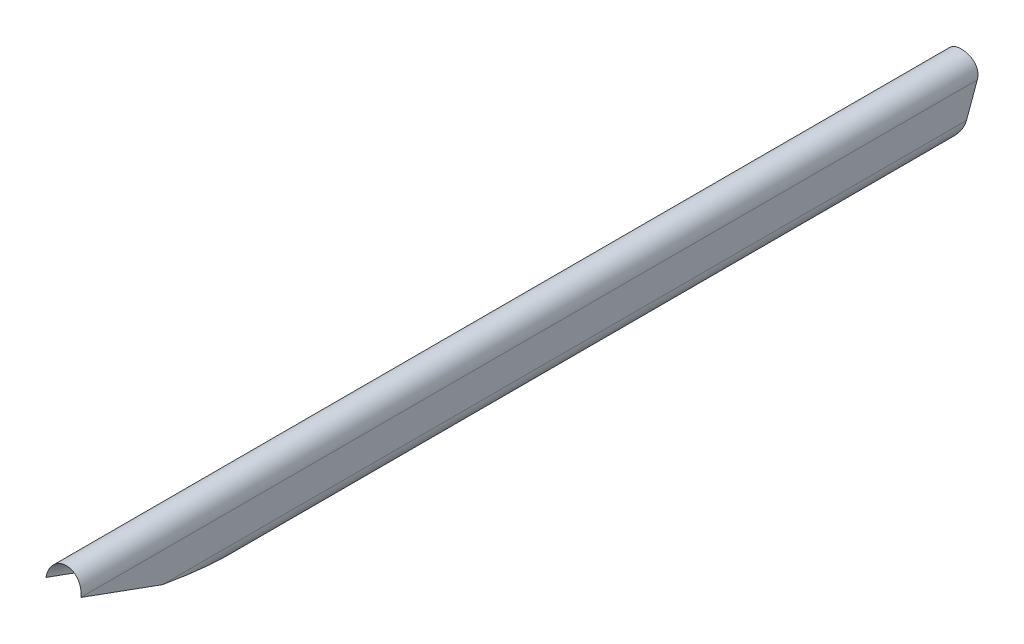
ISO-10303-21;
HEADER;
FILE_DESCRIPTION(('STEP AP214'),'2;1');
FILE_NAME('part.step','',(''),(''),'','','');
FILE_SCHEMA(('AUTOMOTIVE_DESIGN { 1 0 10303 214 1 1 1 1 }'));
ENDSEC;
DATA;
#1=APPLICATION_CONTEXT('core data for automotive mechanical design processes');
#2=APPLICATION_PROTOCOL_DEFINITION('international standard','automotive_design',2000,#1);
#3=PRODUCT_CONTEXT('',#1,'mechanical');
#4=PRODUCT('Part','Part','',(#3));
#5=PRODUCT_RELATED_PRODUCT_CATEGORY('part','',(#4));
#6=PRODUCT_DEFINITION_FORMATION('','',#4);
#7=PRODUCT_DEFINITION_CONTEXT('part definition',#1,'design');
#8=PRODUCT_DEFINITION('design','',#6,#7);
#9=PRODUCT_DEFINITION_SHAPE('','',#8);
#10=(LENGTH_UNIT() NAMED_UNIT(*) SI_UNIT(.MILLI.,.METRE.));
#11=(NAMED_UNIT(*) PLANE_ANGLE_UNIT() SI_UNIT($,.RADIAN.));
#12=(NAMED_UNIT(*) SI_UNIT($,.STERADIAN.) SOLID_ANGLE_UNIT());
#13=UNCERTAINTY_MEASURE_WITH_UNIT(LENGTH_MEASURE(1.E-05),#10,'distance_accuracy_value','');
#14=(GEOMETRIC_REPRESENTATION_CONTEXT(3) GLOBAL_UNCERTAINTY_ASSIGNED_CONTEXT((#13)) GLOBAL_UNIT_ASSIGNED_CONTEXT((#10,
#11,#12)) REPRESENTATION_CONTEXT('',''));
#15=CARTESIAN_POINT('',(0.,0.,0.));
#16=DIRECTION('',(0.,0.,1.));
#17=DIRECTION('',(1.,0.,0.));
#18=AXIS2_PLACEMENT_3D('',#15,#16,#17);
#19=CARTESIAN_POINT('',(0.,0.,390.));
#20=DIRECTION('',(0.,0.,-1.));
#21=DIRECTION('',(-1.,0.,0.));
#22=AXIS2_PLACEMENT_3D('',#19,#20,#21);
#23=CYLINDRICAL_SURFACE('',#22,7.);
#24=DIRECTION('',(0.,0.,-1.));
#25=VECTOR('',#24,1.);
#26=CARTESIAN_POINT('',(-7.,0.,390.));
#27=LINE('',#26,#25);
#28=CARTESIAN_POINT('',(-7.00000000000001,0.,374.246963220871));
#29=VERTEX_POINT('',#28);
#30=CARTESIAN_POINT('',(-7.,0.,12.9024697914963));
#31=VERTEX_POINT('',#30);
#32=EDGE_CURVE('E180',#29,#31,#27,.T.);
#33=ORIENTED_EDGE('',*,*,#32,.F.);
#34=CARTESIAN_POINT('',(0.,0.,374.246963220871));
#35=DIRECTION('',(0.,-0.173648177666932,-0.984807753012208));
#36=DIRECTION('',(0.,0.984807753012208,-0.173648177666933));
#37=AXIS2_PLACEMENT_3D('',#34,#35,#36);
#38=ELLIPSE('',#37,7.10798628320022,7.00000000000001);
#39=CARTESIAN_POINT('',(7.,0.,374.246963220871));
#40=VERTEX_POINT('',#39);
#41=EDGE_CURVE('E181',#29,#40,#38,.T.);
#42=ORIENTED_EDGE('',*,*,#41,.T.);
#43=DIRECTION('',(0.,0.,-1.));
#44=VECTOR('',#43,1.);
#45=CARTESIAN_POINT('',(7.,0.,390.));
#46=LINE('',#45,#44);
#47=CARTESIAN_POINT('',(7.,0.,12.9024697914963));
#48=VERTEX_POINT('',#47);
#49=EDGE_CURVE('E178',#40,#48,#46,.T.);
#50=ORIENTED_EDGE('',*,*,#49,.T.);
#51=CARTESIAN_POINT('',(-7.,0.,12.9024697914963));
#52=CARTESIAN_POINT('',(-7.0000223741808,0.168941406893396,12.8409350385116));
#53=CARTESIAN_POINT('',(-6.99388410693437,0.339158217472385,12.7827823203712));
#54=CARTESIAN_POINT('',(-6.96889639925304,0.681018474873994,12.6736706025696));
#55=CARTESIAN_POINT('',(-6.95004252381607,0.852662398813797,12.622714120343));
#56=CARTESIAN_POINT('',(-6.89928140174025,1.19580699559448,12.5285575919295));
#57=CARTESIAN_POINT('',(-6.86739901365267,1.36730732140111,12.4853429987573));
#58=CARTESIAN_POINT('',(-6.79040922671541,1.70909871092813,12.4067216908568));
#59=CARTESIAN_POINT('',(-6.74530396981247,1.87938996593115,12.3713137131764));
#60=CARTESIAN_POINT('',(-6.64174747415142,2.21778635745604,12.3081370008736));
#61=CARTESIAN_POINT('',(-6.58326364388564,2.38588507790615,12.2803872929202));
#62=CARTESIAN_POINT('',(-6.45322168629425,2.71803990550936,12.2322965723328));
#63=CARTESIAN_POINT('',(-6.38166307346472,2.88209586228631,12.211955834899));
#64=CARTESIAN_POINT('',(-6.2258900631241,3.20474271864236,12.1781161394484));
#65=CARTESIAN_POINT('',(-6.14167978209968,3.36333537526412,12.1646149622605));
#66=CARTESIAN_POINT('',(-5.96112333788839,3.67386269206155,12.1436930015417));
#67=CARTESIAN_POINT('',(-5.86477731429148,3.82579742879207,12.1362721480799));
#68=CARTESIAN_POINT('',(-5.66163063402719,4.12039178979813,12.1266893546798));
#69=CARTESIAN_POINT('',(-5.55494634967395,4.26313006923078,12.1244746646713));
#70=CARTESIAN_POINT('',(-5.33096924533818,4.54009897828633,12.1242459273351));
#71=CARTESIAN_POINT('',(-5.21367288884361,4.67432674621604,12.1262332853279));
#72=CARTESIAN_POINT('',(-4.96918911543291,4.93344726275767,12.1334950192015));
#73=CARTESIAN_POINT('',(-4.84199781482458,5.05833630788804,12.1387706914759));
#74=CARTESIAN_POINT('',(-4.57852833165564,5.29799929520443,12.1517129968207));
#75=CARTESIAN_POINT('',(-4.44224966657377,5.41277269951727,12.1593797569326));
#76=CARTESIAN_POINT('',(-4.15134826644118,5.63938710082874,12.1768568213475));
#77=CARTESIAN_POINT('',(-3.99611066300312,5.7504309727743,12.1867812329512));
#78=CARTESIAN_POINT('',(-3.67719181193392,5.95941228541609,12.2074275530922));
#79=CARTESIAN_POINT('',(-3.51351380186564,6.05735470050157,12.2181491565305));
#80=CARTESIAN_POINT('',(-3.17864303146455,6.23959764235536,12.2395334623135));
#81=CARTESIAN_POINT('',(-3.00744736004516,6.32389282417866,12.2501961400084));
#82=CARTESIAN_POINT('',(-2.65876934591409,6.47821591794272,12.2707012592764));
#83=CARTESIAN_POINT('',(-2.48128929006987,6.54824895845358,12.2805439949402));
#84=CARTESIAN_POINT('',(-2.11511078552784,6.67571212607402,12.2990863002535));
#85=CARTESIAN_POINT('',(-1.92623565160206,6.73264266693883,12.3077366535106));
#86=CARTESIAN_POINT('',(-1.54427047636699,6.83038012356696,12.3229364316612));
#87=CARTESIAN_POINT('',(-1.35118032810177,6.87118662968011,12.3294858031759));
#88=CARTESIAN_POINT('',(-0.962177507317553,6.93636114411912,12.3400834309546));
#89=CARTESIAN_POINT('',(-0.76626485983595,6.96072929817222,12.3441317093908));
#90=CARTESIAN_POINT('',(-0.373046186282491,6.99283549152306,12.349486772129));
#91=CARTESIAN_POINT('',(-0.175740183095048,7.00057380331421,12.3507936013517));
#92=CARTESIAN_POINT('',(0.216532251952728,6.99936695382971,12.3505907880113));
#93=CARTESIAN_POINT('',(0.41149931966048,6.99061393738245,12.349113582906));
#94=CARTESIAN_POINT('',(0.799982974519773,6.95687008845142,12.3434911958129));
#95=CARTESIAN_POINT('',(0.993499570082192,6.93187935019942,12.3393460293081));
#96=CARTESIAN_POINT('',(1.37769807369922,6.86585313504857,12.3286285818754));
#97=CARTESIAN_POINT('',(1.56838009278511,6.82481828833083,12.3220563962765));
#98=CARTESIAN_POINT('',(1.94558052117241,6.72701113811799,12.3068777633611));
#99=CARTESIAN_POINT('',(2.13209891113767,6.67023876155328,12.2982713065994));
#100=CARTESIAN_POINT('',(2.49956047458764,6.54141258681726,12.2795697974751));
#101=CARTESIAN_POINT('',(2.68050733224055,6.46936914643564,12.2694757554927));
#102=CARTESIAN_POINT('',(3.03573187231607,6.3104825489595,12.2484718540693));
#103=CARTESIAN_POINT('',(3.21000954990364,6.22363938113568,12.2375619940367));
#104=CARTESIAN_POINT('',(3.55075183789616,6.03572868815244,12.2157324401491));
#105=CARTESIAN_POINT('',(3.71721533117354,5.93465913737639,12.2048127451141));
#106=CARTESIAN_POINT('',(4.04126226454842,5.71892509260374,12.1838887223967));
#107=CARTESIAN_POINT('',(4.19884149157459,5.60425422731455,12.1738848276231));
#108=CARTESIAN_POINT('',(4.50595590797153,5.36053070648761,12.155717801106));
#109=CARTESIAN_POINT('',(4.65535928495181,5.23130989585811,12.1475803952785));
#110=CARTESIAN_POINT('',(4.94271855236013,4.96069196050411,12.1344907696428));
#111=CARTESIAN_POINT('',(5.08068007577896,4.8193008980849,12.1295369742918));
#112=CARTESIAN_POINT('',(5.34415426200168,4.52536758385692,12.1240421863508));
#113=CARTESIAN_POINT('',(5.46967171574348,4.37282966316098,12.1234994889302));
#114=CARTESIAN_POINT('',(5.70733201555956,4.05774490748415,12.128070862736));
#115=CARTESIAN_POINT('',(5.8194756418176,3.89519865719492,12.1331846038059));
#116=CARTESIAN_POINT('',(6.02600519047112,3.5670145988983,12.1499823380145));
#117=CARTESIAN_POINT('',(6.12085719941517,3.40165878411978,12.161442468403));
#118=CARTESIAN_POINT('',(6.2965314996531,3.06428723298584,12.1917349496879));
#119=CARTESIAN_POINT('',(6.37735360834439,2.89227140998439,12.2105673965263));
#120=CARTESIAN_POINT('',(6.52443030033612,2.543165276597,12.2563728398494));
#121=CARTESIAN_POINT('',(6.59068462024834,2.36607487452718,12.2833459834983));
#122=CARTESIAN_POINT('',(6.70829328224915,2.00853216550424,12.3459314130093));
#123=CARTESIAN_POINT('',(6.75965074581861,1.8280805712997,12.3815418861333));
#124=CARTESIAN_POINT('',(6.83674497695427,1.50959292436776,12.4518421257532));
#125=CARTESIAN_POINT('',(6.86567491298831,1.37190171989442,12.4846541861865));
#126=CARTESIAN_POINT('',(6.91503791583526,1.0962866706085,12.5552694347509));
#127=CARTESIAN_POINT('',(6.93547189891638,0.958362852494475,12.5930720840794));
#128=CARTESIAN_POINT('',(6.96797248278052,0.683049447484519,12.67349423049));
#129=CARTESIAN_POINT('',(6.98004486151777,0.545659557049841,12.7161103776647));
#130=CARTESIAN_POINT('',(6.99606252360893,0.271911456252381,12.8059207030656));
#131=CARTESIAN_POINT('',(7.00000824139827,0.135553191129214,12.853114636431));
#132=CARTESIAN_POINT('',(7.,0.,12.9024697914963));
#133=B_SPLINE_CURVE_WITH_KNOTS('',3,(#51,#52,#53,#54,#55,#56,#57,#58,#59,#60,#61,#62,#63,#64,
#65,#66,#67,#68,#69,#70,#71,#72,#73,#74,#75,#76,#77,#78,#79,#80,#81,#82,#83,#84,#85,#86,#87,#88,
#89,#90,#91,#92,#93,#94,#95,#96,#97,#98,#99,#100,#101,#102,#103,#104,#105,#106,#107,#108,#109,
#110,#111,#112,#113,#114,#115,#116,#117,#118,#119,#120,#121,#122,#123,#124,#125,#126,#127,#128,
#129,#130,#131,#132),.UNSPECIFIED.,.F.,.F.,(4,2,2,2,2,2,2,2,2,2,2,2,2,2,2,2,2,2,2,2,2,2,2,2,2,2,
2,2,2,2,2,2,2,2,2,2,2,2,2,2,4),(0.,0.539317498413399,1.07882319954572,1.61730428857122,
2.15569819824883,2.69541792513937,3.23515769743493,3.77472223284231,4.3142805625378,
4.84834794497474,5.38259396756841,5.91705074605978,6.45153592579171,7.02425634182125,
7.59675868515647,8.16948470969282,8.74200442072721,9.33366361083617,9.92533783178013,
10.5170068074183,11.108666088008,11.6934743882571,12.2782792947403,12.8630612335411,
13.4478458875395,14.0322351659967,14.6166248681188,15.2010978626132,15.7858457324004,
16.3782246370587,16.9703101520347,17.5621668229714,18.1539889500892,18.7261545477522,
19.2983275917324,19.870510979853,20.4425743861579,20.8756726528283,21.3087241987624,
21.7414762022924,22.1742050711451),.UNSPECIFIED.);
#134=EDGE_CURVE('E145',#31,#48,#133,.T.);
#135=ORIENTED_EDGE('',*,*,#134,.F.);
#136=EDGE_LOOP('',(#33,#42,#50,#135));
#137=FACE_BOUND('',#136,.T.);
#138=ADVANCED_FACE('F28',(#137),#23,.T.);
#139=CARTESIAN_POINT('',(-7.,0.,390.));
#140=DIRECTION('',(1.,0.,0.));
#141=DIRECTION('',(0.,0.,-1.));
#142=AXIS2_PLACEMENT_3D('',#139,#140,#141);
#143=PLANE('',#142);
#144=DIRECTION('',(0.,-0.342020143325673,-0.939692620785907));
#145=VECTOR('',#144,1.);
#146=CARTESIAN_POINT('',(-7.00000000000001,5.88177287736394,390.407001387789));
#147=LINE('',#146,#145);
#148=CARTESIAN_POINT('',(-7.00000000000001,-12.,341.277234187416));
#149=VERTEX_POINT('',#148);
#150=EDGE_CURVE('E186',#29,#149,#147,.T.);
#151=ORIENTED_EDGE('',*,*,#150,.F.);
#152=ORIENTED_EDGE('',*,*,#32,.T.);
#153=DIRECTION('',(0.,-0.939692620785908,0.342020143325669));
#154=VECTOR('',#153,1.);
#155=CARTESIAN_POINT('',(-7.,10.3279294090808,9.14341090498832));
#156=LINE('',#155,#154);
#157=CARTESIAN_POINT('',(-7.,-12.,17.2701126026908));
#158=VERTEX_POINT('',#157);
#159=EDGE_CURVE('E144',#158,#31,#156,.F.);
#160=ORIENTED_EDGE('',*,*,#159,.F.);
#161=DIRECTION('',(0.,0.,-1.));
#162=VECTOR('',#161,1.);
#163=CARTESIAN_POINT('',(-7.,-12.,390.));
#164=LINE('',#163,#162);
#165=EDGE_CURVE('E173',#149,#158,#164,.T.);
#166=ORIENTED_EDGE('',*,*,#165,.F.);
#167=EDGE_LOOP('',(#151,#152,#160,#166));
#168=FACE_BOUND('',#167,.T.);
#169=ADVANCED_FACE('F155',(#168),#143,.F.);
#170=CARTESIAN_POINT('',(7.,0.,390.));
#171=DIRECTION('',(1.,0.,0.));
#172=DIRECTION('',(0.,1.,0.));
#173=AXIS2_PLACEMENT_3D('',#170,#171,#172);
#174=PLANE('',#173);
#175=ORIENTED_EDGE('',*,*,#49,.F.);
#176=DIRECTION('',(0.,-0.342020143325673,-0.939692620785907));
#177=VECTOR('',#176,1.);
#178=CARTESIAN_POINT('',(7.,5.88177287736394,390.407001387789));
#179=LINE('',#178,#177);
#180=CARTESIAN_POINT('',(7.,-12.,341.277234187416));
#181=VERTEX_POINT('',#180);
#182=EDGE_CURVE('E183',#40,#181,#179,.T.);
#183=ORIENTED_EDGE('',*,*,#182,.T.);
#184=DIRECTION('',(0.,0.,-1.));
#185=VECTOR('',#184,1.);
#186=CARTESIAN_POINT('',(7.,-12.,390.));
#187=LINE('',#186,#185);
#188=CARTESIAN_POINT('',(7.,-12.,17.2701126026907));
#189=VERTEX_POINT('',#188);
#190=EDGE_CURVE('E182',#181,#189,#187,.T.);
#191=ORIENTED_EDGE('',*,*,#190,.T.);
#192=DIRECTION('',(0.,-0.939692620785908,0.342020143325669));
#193=VECTOR('',#192,1.);
#194=CARTESIAN_POINT('',(7.,10.3279294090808,9.14341090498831));
#195=LINE('',#194,#193);
#196=EDGE_CURVE('E146',#189,#48,#195,.F.);
#197=ORIENTED_EDGE('',*,*,#196,.T.);
#198=EDGE_LOOP('',(#175,#183,#191,#197));
#199=FACE_BOUND('',#198,.T.);
#200=ADVANCED_FACE('F153',(#199),#174,.T.);
#201=CARTESIAN_POINT('',(0.,-12.,390.));
#202=DIRECTION('',(0.,0.,-1.));
#203=DIRECTION('',(-1.,0.,0.));
#204=AXIS2_PLACEMENT_3D('',#201,#202,#203);
#205=CYLINDRICAL_SURFACE('',#204,7.);
#206=ORIENTED_EDGE('',*,*,#190,.F.);
#207=CARTESIAN_POINT('',(0.,-12.,341.277234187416));
#208=DIRECTION('',(0.,0.984807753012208,-0.173648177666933));
#209=DIRECTION('',(0.,-0.173648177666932,-0.984807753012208));
#210=AXIS2_PLACEMENT_3D('',#207,#208,#209);
#211=ELLIPSE('',#210,40.311393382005,7.00000000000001);
#212=EDGE_CURVE('E175',#181,#149,#211,.T.);
#213=ORIENTED_EDGE('',*,*,#212,.T.);
#214=ORIENTED_EDGE('',*,*,#165,.T.);
#215=CARTESIAN_POINT('',(7.,-12.,17.2701126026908));
#216=CARTESIAN_POINT('',(7.00000471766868,-12.2124747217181,17.3473876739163));
#217=CARTESIAN_POINT('',(6.99032899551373,-12.4228711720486,17.4299676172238));
#218=CARTESIAN_POINT('',(6.95277859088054,-12.8379821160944,17.6040309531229));
#219=CARTESIAN_POINT('',(6.92492796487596,-13.042703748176,17.6955024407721));
#220=CARTESIAN_POINT('',(6.85242182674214,-13.4441887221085,17.8852318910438));
#221=CARTESIAN_POINT('',(6.8078775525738,-13.6409953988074,17.9834414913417));
#222=CARTESIAN_POINT('',(6.70296944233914,-14.0273848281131,18.1855814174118));
#223=CARTESIAN_POINT('',(6.64260000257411,-14.2169649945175,18.2895137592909));
#224=CARTESIAN_POINT('',(6.50727245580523,-14.5872888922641,18.500904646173));
#225=CARTESIAN_POINT('',(6.4323949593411,-14.7680748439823,18.6083410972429));
#226=CARTESIAN_POINT('',(6.26851057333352,-15.1214920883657,18.8257413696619));
#227=CARTESIAN_POINT('',(6.17950525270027,-15.2941242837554,18.9357049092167));
#228=CARTESIAN_POINT('',(5.98749674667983,-15.631484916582,19.1570803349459));
#229=CARTESIAN_POINT('',(5.88444640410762,-15.7961840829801,19.2684959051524));
#230=CARTESIAN_POINT('',(5.66488531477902,-16.1166495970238,19.4909309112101));
#231=CARTESIAN_POINT('',(5.54837361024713,-16.272415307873,19.6019503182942));
#232=CARTESIAN_POINT('',(5.28305041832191,-16.5978247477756,19.8390793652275));
#233=CARTESIAN_POINT('',(5.13202874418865,-16.7659041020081,19.9648757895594));
#234=CARTESIAN_POINT('',(4.81234931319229,-17.0885032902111,20.2115414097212));
#235=CARTESIAN_POINT('',(4.64368724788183,-17.2430197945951,20.3324093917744));
#236=CARTESIAN_POINT('',(4.28934609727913,-17.5366330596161,20.5662049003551));
#237=CARTESIAN_POINT('',(4.10371641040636,-17.6757721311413,20.6791538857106));
#238=CARTESIAN_POINT('',(3.71526786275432,-17.9373017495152,20.8945569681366));
#239=CARTESIAN_POINT('',(3.51245273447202,-18.0596959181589,20.9970133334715));
#240=CARTESIAN_POINT('',(3.16453309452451,-18.2457867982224,21.1545914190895));
#241=CARTESIAN_POINT('',(3.02416011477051,-18.3150069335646,21.2137046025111));
#242=CARTESIAN_POINT('',(2.73687364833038,-18.4447144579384,21.3251912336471));
#243=CARTESIAN_POINT('',(2.58996210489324,-18.5052044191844,21.3775666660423));
#244=CARTESIAN_POINT('',(2.29017778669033,-18.6166946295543,21.4746118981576));
#245=CARTESIAN_POINT('',(2.13730765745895,-18.6676990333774,21.5192850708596));
#246=CARTESIAN_POINT('',(1.8263612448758,-18.7594871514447,21.6000107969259));
#247=CARTESIAN_POINT('',(1.66828707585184,-18.8002749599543,21.6360668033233));
#248=CARTESIAN_POINT('',(1.34658741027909,-18.871247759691,21.698991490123));
#249=CARTESIAN_POINT('',(1.18292760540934,-18.9013452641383,21.7257843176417));
#250=CARTESIAN_POINT('',(0.852534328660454,-18.9498963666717,21.7690821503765));
#251=CARTESIAN_POINT('',(0.68580087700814,-18.9683500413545,21.7855872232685));
#252=CARTESIAN_POINT('',(0.35078455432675,-18.9932218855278,21.807846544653));
#253=CARTESIAN_POINT('',(0.182502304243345,-18.9996446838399,21.8136049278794));
#254=CARTESIAN_POINT('',(-0.154098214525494,-19.0003265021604,21.8142157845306));
#255=CARTESIAN_POINT('',(-0.322416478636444,-18.9945866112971,21.8090692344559));
#256=CARTESIAN_POINT('',(-0.638388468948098,-18.97241799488,21.7892269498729));
#257=CARTESIAN_POINT('',(-0.786209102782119,-18.9572833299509,21.7756875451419));
#258=CARTESIAN_POINT('',(-1.07968284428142,-18.9178183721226,21.7404655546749));
#259=CARTESIAN_POINT('',(-1.22533522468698,-18.8934850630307,21.7187802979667));
#260=CARTESIAN_POINT('',(-1.51346712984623,-18.8360073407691,21.6677233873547));
#261=CARTESIAN_POINT('',(-1.65594747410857,-18.8028652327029,21.6383537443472));
#262=CARTESIAN_POINT('',(-1.93706376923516,-18.7282200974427,21.5724776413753));
#263=CARTESIAN_POINT('',(-2.07569815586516,-18.6867137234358,21.5359683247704));
#264=CARTESIAN_POINT('',(-2.35367135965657,-18.5941264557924,21.4549345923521));
#265=CARTESIAN_POINT('',(-2.49283437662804,-18.542740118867,21.4101570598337));
#266=CARTESIAN_POINT('',(-2.76580357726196,-18.4321096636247,21.3143478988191));
#267=CARTESIAN_POINT('',(-2.8996080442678,-18.3728630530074,21.2633142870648));
#268=CARTESIAN_POINT('',(-3.29236870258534,-18.1842259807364,21.1019798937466));
#269=CARTESIAN_POINT('',(-3.54274611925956,-18.0439131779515,20.9834233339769));
#270=CARTESIAN_POINT('',(-4.13940923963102,-17.6610037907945,20.6659719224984));
#271=CARTESIAN_POINT('',(-4.47013247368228,-17.4025733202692,20.4567772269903));
#272=CARTESIAN_POINT('',(-4.92307128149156,-16.9805795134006,20.1284347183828));
#273=CARTESIAN_POINT('',(-5.06707018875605,-16.833908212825,20.0163567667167));
#274=CARTESIAN_POINT('',(-5.34064862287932,-16.5298190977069,19.789106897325));
#275=CARTESIAN_POINT('',(-5.47022966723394,-16.3724024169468,19.6739353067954));
#276=CARTESIAN_POINT('',(-5.71679668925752,-16.0448687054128,19.4403890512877));
#277=CARTESIAN_POINT('',(-5.83354029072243,-15.8745852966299,19.3219928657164));
#278=CARTESIAN_POINT('',(-6.05168864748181,-15.5241533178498,19.0856140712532));
#279=CARTESIAN_POINT('',(-6.15309226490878,-15.3440040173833,18.9676314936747));
#280=CARTESIAN_POINT('',(-6.33979540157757,-14.9748374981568,18.7342089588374));
#281=CARTESIAN_POINT('',(-6.42514102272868,-14.7858476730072,18.6187625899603));
#282=CARTESIAN_POINT('',(-6.57938563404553,-14.3989653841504,18.3918654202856));
#283=CARTESIAN_POINT('',(-6.64828726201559,-14.2010743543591,18.2804139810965));
#284=CARTESIAN_POINT('',(-6.75538201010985,-13.8416755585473,18.0873839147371));
#285=CARTESIAN_POINT('',(-6.796996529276,-13.6818014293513,18.0046502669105));
#286=CARTESIAN_POINT('',(-6.86913525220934,-13.3574159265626,17.8436536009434));
#287=CARTESIAN_POINT('',(-6.89966322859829,-13.1929061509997,17.7653890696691));
#288=CARTESIAN_POINT('',(-6.94914413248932,-12.8590526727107,17.6139149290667));
#289=CARTESIAN_POINT('',(-6.96805135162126,-12.6896925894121,17.5407262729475));
#290=CARTESIAN_POINT('',(-6.9934869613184,-12.3473455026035,17.400537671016));
#291=CARTESIAN_POINT('',(-7.00000403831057,-12.1743553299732,17.3335434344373));
#292=CARTESIAN_POINT('',(-7.,-12.,17.2701126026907));
#293=B_SPLINE_CURVE_WITH_KNOTS('',3,(#215,#216,#217,#218,#219,#220,#221,#222,#223,#224,#225,
#226,#227,#228,#229,#230,#231,#232,#233,#234,#235,#236,#237,#238,#239,#240,#241,#242,#243,#244,
#245,#246,#247,#248,#249,#250,#251,#252,#253,#254,#255,#256,#257,#258,#259,#260,#261,#262,#263,
#264,#265,#266,#267,#268,#269,#270,#271,#272,#273,#274,#275,#276,#277,#278,#279,#280,#281,#282,
#283,#284,#285,#286,#287,#288,#289,#290,#291,#292),.UNSPECIFIED.,.F.,.F.,(4,2,2,2,2,2,2,2,2,2,2,
2,2,2,2,2,2,2,2,2,2,2,2,2,2,2,2,2,2,2,2,2,2,2,2,2,2,2,4),(0.,0.677792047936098,1.35468877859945,
2.02715297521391,2.69985561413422,3.36892250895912,4.03791515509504,4.70921202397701,
5.38055668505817,6.15543495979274,6.9305029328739,7.70338223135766,8.4760940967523,
8.97757559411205,9.47890903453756,9.98002236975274,10.4809345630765,10.9858564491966,
11.4907750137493,11.9954992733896,12.5001783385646,12.9472845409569,13.3945374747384,
13.8416734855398,14.2889887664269,14.7534099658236,15.217978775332,16.1468750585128,
17.5457128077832,18.2475501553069,18.949313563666,19.6626260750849,20.3759914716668,
21.0872764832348,21.7984473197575,22.3523222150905,22.9060084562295,23.4618588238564,
24.0182165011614),.UNSPECIFIED.);
#294=EDGE_CURVE('E137',#189,#158,#293,.T.);
#295=ORIENTED_EDGE('',*,*,#294,.F.);
#296=EDGE_LOOP('',(#206,#213,#214,#295));
#297=FACE_BOUND('',#296,.T.);
#298=ADVANCED_FACE('F147',(#297),#205,.T.);
#299=CARTESIAN_POINT('',(0.,0.,390.));
#300=DIRECTION('',(0.,0.,-1.));
#301=DIRECTION('',(-1.,0.,0.));
#302=AXIS2_PLACEMENT_3D('',#299,#300,#301);
#303=CYLINDRICAL_SURFACE('',#302,5.);
#304=CARTESIAN_POINT('',(-5.,0.,359.923305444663));
#305=CARTESIAN_POINT('',(-4.9999988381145,0.0723525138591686,360.122089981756));
#306=CARTESIAN_POINT('',(-4.99843339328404,0.146207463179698,360.320327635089));
#307=CARTESIAN_POINT('',(-4.99172727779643,0.297289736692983,360.715449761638));
#308=CARTESIAN_POINT('',(-4.98658676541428,0.374516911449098,360.912334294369));
#309=CARTESIAN_POINT('',(-4.97216406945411,0.532831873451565,361.304621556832));
#310=CARTESIAN_POINT('',(-4.96287788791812,0.613923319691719,361.500022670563));
#311=CARTESIAN_POINT('',(-4.93944524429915,0.780349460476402,361.888721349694));
#312=CARTESIAN_POINT('',(-4.92529890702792,0.865684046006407,362.082018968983));
#313=CARTESIAN_POINT('',(-4.89133259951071,1.04055468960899,362.464803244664));
#314=CARTESIAN_POINT('',(-4.87154726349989,1.13006239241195,362.654305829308));
#315=CARTESIAN_POINT('',(-4.82512059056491,1.31424375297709,363.029991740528));
#316=CARTESIAN_POINT('',(-4.79847825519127,1.40891816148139,363.216174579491));
#317=CARTESIAN_POINT('',(-4.73694765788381,1.60366423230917,363.583883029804));
#318=CARTESIAN_POINT('',(-4.70207490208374,1.70372547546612,363.765416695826));
#319=CARTESIAN_POINT('',(-4.62227664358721,1.90964805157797,364.122851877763));
#320=CARTESIAN_POINT('',(-4.57735603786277,2.01550654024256,364.298756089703));
#321=CARTESIAN_POINT('',(-4.49102719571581,2.19944474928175,364.590176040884));
#322=CARTESIAN_POINT('',(-4.4528086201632,2.27602248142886,364.707584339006));
#323=CARTESIAN_POINT('',(-4.36970311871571,2.43176751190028,364.938276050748));
#324=CARTESIAN_POINT('',(-4.3248160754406,2.51093485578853,365.051559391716));
#325=CARTESIAN_POINT('',(-4.22750500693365,2.67151669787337,365.273225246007));
#326=CARTESIAN_POINT('',(-4.1750815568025,2.75293102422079,365.381608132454));
#327=CARTESIAN_POINT('',(-4.06189297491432,2.91736443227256,365.592589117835));
#328=CARTESIAN_POINT('',(-4.0011278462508,3.00038351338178,365.695187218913));
#329=CARTESIAN_POINT('',(-3.80343324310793,3.25264906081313,365.995259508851));
#330=CARTESIAN_POINT('',(-3.65208923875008,3.42338214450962,366.182637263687));
#331=CARTESIAN_POINT('',(-3.39410091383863,3.67348122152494,366.43762676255));
#332=CARTESIAN_POINT('',(-3.30292152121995,3.75586328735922,366.51829053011));
#333=CARTESIAN_POINT('',(-3.110185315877,3.91694980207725,366.670471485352));
#334=CARTESIAN_POINT('',(-3.00862951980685,3.99565461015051,366.741989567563));
#335=CARTESIAN_POINT('',(-2.80296345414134,4.14224859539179,366.87080147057));
#336=CARTESIAN_POINT('',(-2.69951943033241,4.21050930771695,366.928737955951));
#337=CARTESIAN_POINT('',(-2.48462656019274,4.34078476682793,367.036206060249));
#338=CARTESIAN_POINT('',(-2.37317780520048,4.40279958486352,367.085737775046));
#339=CARTESIAN_POINT('',(-2.14314648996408,4.51924137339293,367.176438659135));
#340=CARTESIAN_POINT('',(-2.02456417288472,4.57366860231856,367.217608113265));
#341=CARTESIAN_POINT('',(-1.7813107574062,4.67378056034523,367.291755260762));
#342=CARTESIAN_POINT('',(-1.65664028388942,4.71946618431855,367.324733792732));
#343=CARTESIAN_POINT('',(-1.41881061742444,4.7958843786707,367.378984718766));
#344=CARTESIAN_POINT('',(-1.30624321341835,4.82778596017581,367.401218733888));
#345=CARTESIAN_POINT('',(-1.07815368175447,4.88378710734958,367.439815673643));
#346=CARTESIAN_POINT('',(-0.962630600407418,4.90788411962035,367.456176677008));
#347=CARTESIAN_POINT('',(-0.729587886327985,4.94789573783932,367.483143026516));
#348=CARTESIAN_POINT('',(-0.612069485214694,4.96381521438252,367.493751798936));
#349=CARTESIAN_POINT('',(-0.375783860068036,4.98727245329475,367.509329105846));
#350=CARTESIAN_POINT('',(-0.257016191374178,4.99480712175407,367.514295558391));
#351=CARTESIAN_POINT('',(-0.0209035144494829,5.00133031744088,367.518597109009));
#352=CARTESIAN_POINT('',(0.0964365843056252,5.00044347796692,367.518014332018));
#353=CARTESIAN_POINT('',(0.330654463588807,4.99043202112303,367.511406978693));
#354=CARTESIAN_POINT('',(0.447532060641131,4.98130441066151,367.50538042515));
#355=CARTESIAN_POINT('',(0.679900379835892,4.95493713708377,367.487830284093));
#356=CARTESIAN_POINT('',(0.795391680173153,4.93770098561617,367.476309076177));
#357=CARTESIAN_POINT('',(1.02425927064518,4.89534891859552,367.447664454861));
#358=CARTESIAN_POINT('',(1.13763477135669,4.87023012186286,367.430538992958));
#359=CARTESIAN_POINT('',(1.36144475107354,4.81246586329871,367.390548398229));
#360=CARTESIAN_POINT('',(1.47187857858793,4.77981874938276,367.367682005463));
#361=CARTESIAN_POINT('',(1.68900097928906,4.70748015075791,367.316060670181));
#362=CARTESIAN_POINT('',(1.79568949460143,4.66778855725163,367.287305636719));
#363=CARTESIAN_POINT('',(2.00455919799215,4.58197413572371,367.223770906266));
#364=CARTESIAN_POINT('',(2.10674145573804,4.5358528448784,367.188992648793));
#365=CARTESIAN_POINT('',(2.305959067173,4.43789074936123,367.113295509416));
#366=CARTESIAN_POINT('',(2.40299437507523,4.38604989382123,367.072376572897));
#367=CARTESIAN_POINT('',(2.59154568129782,4.27735415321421,366.98425302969));
#368=CARTESIAN_POINT('',(2.6830494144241,4.22048876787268,366.937035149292));
#369=CARTESIAN_POINT('',(2.85988968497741,4.10272131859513,366.83639715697));
#370=CARTESIAN_POINT('',(2.94522390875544,4.04181775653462,366.782974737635));
#371=CARTESIAN_POINT('',(3.10936122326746,3.91695092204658,366.670089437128));
#372=CARTESIAN_POINT('',(3.1881658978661,3.85298839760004,366.610628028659));
#373=CARTESIAN_POINT('',(3.33913255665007,3.72291913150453,366.485889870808));
#374=CARTESIAN_POINT('',(3.41129331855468,3.65681199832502,366.420612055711));
#375=CARTESIAN_POINT('',(3.56969561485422,3.50325951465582,366.264101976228));
#376=CARTESIAN_POINT('',(3.65364325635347,3.41537719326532,366.170969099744));
#377=CARTESIAN_POINT('',(3.81070899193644,3.23920359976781,365.976344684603));
#378=CARTESIAN_POINT('',(3.88382416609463,3.15091222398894,365.874850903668));
#379=CARTESIAN_POINT('',(4.02004036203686,2.97517343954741,365.664418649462));
#380=CARTESIAN_POINT('',(4.08312789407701,2.88772731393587,365.555470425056));
#381=CARTESIAN_POINT('',(4.20011981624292,2.71475493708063,365.331278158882));
#382=CARTESIAN_POINT('',(4.25402075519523,2.62922941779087,365.216031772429));
#383=CARTESIAN_POINT('',(4.38489582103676,2.40792599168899,364.906280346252));
#384=CARTESIAN_POINT('',(4.45513714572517,2.27427477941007,364.707401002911));
#385=CARTESIAN_POINT('',(4.57820877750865,2.01509130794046,364.299236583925));
#386=CARTESIAN_POINT('',(4.63102577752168,1.8895653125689,364.089943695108));
#387=CARTESIAN_POINT('',(4.72294677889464,1.64642075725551,363.663254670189));
#388=CARTESIAN_POINT('',(4.76201707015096,1.52882219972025,363.445840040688));
#389=CARTESIAN_POINT('',(4.81234493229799,1.35824428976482,363.115586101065));
#390=CARTESIAN_POINT('',(4.82773967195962,1.30236259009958,363.004829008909));
#391=CARTESIAN_POINT('',(4.8560626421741,1.19242652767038,362.782094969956));
#392=CARTESIAN_POINT('',(4.86899084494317,1.13837218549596,362.670118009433));
#393=CARTESIAN_POINT('',(4.90040397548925,0.997092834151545,362.371293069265));
#394=CARTESIAN_POINT('',(4.9169687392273,0.911375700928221,362.1835294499));
#395=CARTESIAN_POINT('',(4.94502806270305,0.744226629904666,361.805716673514));
#396=CARTESIAN_POINT('',(4.95652189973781,0.662795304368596,361.615667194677));
#397=CARTESIAN_POINT('',(4.97520403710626,0.5037465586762,361.233664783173));
#398=CARTESIAN_POINT('',(4.98239018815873,0.426131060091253,361.041710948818));
#399=CARTESIAN_POINT('',(4.99304599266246,0.274349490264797,360.656336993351));
#400=CARTESIAN_POINT('',(4.99651540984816,0.200183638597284,360.462916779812));
#401=CARTESIAN_POINT('',(5.0020962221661,-0.0180510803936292,359.879951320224));
#402=CARTESIAN_POINT('',(4.99934043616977,-0.157480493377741,359.488617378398));
#403=CARTESIAN_POINT('',(4.98359833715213,-0.426414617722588,358.702931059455));
#404=CARTESIAN_POINT('',(4.97061459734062,-0.555921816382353,358.308579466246));
#405=CARTESIAN_POINT('',(4.93589404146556,-0.808295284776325,357.513525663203));
#406=CARTESIAN_POINT('',(4.91406554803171,-0.931076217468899,357.112800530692));
#407=CARTESIAN_POINT('',(4.86271535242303,-1.17000808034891,356.309859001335));
#408=CARTESIAN_POINT('',(4.8331932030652,-1.28615862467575,355.907642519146));
#409=CARTESIAN_POINT('',(4.76712848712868,-1.51273821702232,355.103137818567));
#410=CARTESIAN_POINT('',(4.73060141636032,-1.62317922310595,354.700851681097));
#411=CARTESIAN_POINT('',(4.65075398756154,-1.83950337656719,353.895748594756));
#412=CARTESIAN_POINT('',(4.6074338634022,-1.94538668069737,353.492931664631));
#413=CARTESIAN_POINT('',(4.50509695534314,-2.17313975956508,352.610206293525));
#414=CARTESIAN_POINT('',(4.44466231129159,-2.29420484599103,352.130254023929));
#415=CARTESIAN_POINT('',(4.31374814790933,-2.53179206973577,351.170541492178));
#416=CARTESIAN_POINT('',(4.24326759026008,-2.64831373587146,350.690781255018));
#417=CARTESIAN_POINT('',(4.09103483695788,-2.8779330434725,349.730108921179));
#418=CARTESIAN_POINT('',(4.00923797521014,-2.99101483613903,349.249200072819));
#419=CARTESIAN_POINT('',(3.8330523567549,-3.21369968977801,348.289035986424));
#420=CARTESIAN_POINT('',(3.73866748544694,-3.32330381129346,347.80978028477));
#421=CARTESIAN_POINT('',(3.53626755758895,-3.53784203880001,346.860480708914));
#422=CARTESIAN_POINT('',(3.42846423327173,-3.64282027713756,346.390402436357));
#423=CARTESIAN_POINT('',(3.25276871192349,-3.79810075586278,345.68798140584));
#424=CARTESIAN_POINT('',(3.19182902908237,-3.84952810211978,345.454144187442));
#425=CARTESIAN_POINT('',(3.06455089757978,-3.95160708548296,344.98778041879));
#426=CARTESIAN_POINT('',(2.99821279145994,-4.00225877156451,344.755253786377));
#427=CARTESIAN_POINT('',(2.85962671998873,-4.10241374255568,344.293428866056));
#428=CARTESIAN_POINT('',(2.7874199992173,-4.1519223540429,344.064119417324));
#429=CARTESIAN_POINT('',(2.6354178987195,-4.25003153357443,343.607838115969));
#430=CARTESIAN_POINT('',(2.55562337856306,-4.29863220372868,343.380866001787));
#431=CARTESIAN_POINT('',(2.38670455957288,-4.39466375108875,342.930673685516));
#432=CARTESIAN_POINT('',(2.29759873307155,-4.44209672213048,342.707447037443));
#433=CARTESIAN_POINT('',(2.10712713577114,-4.53556388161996,342.266027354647));
#434=CARTESIAN_POINT('',(2.00576997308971,-4.58159902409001,342.047830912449));
#435=CARTESIAN_POINT('',(1.86961108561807,-4.63738568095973,341.782566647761));
#436=CARTESIAN_POINT('',(1.84282481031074,-4.64810218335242,341.731569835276));
#437=CARTESIAN_POINT('',(1.78816657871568,-4.66940293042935,341.630128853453));
#438=CARTESIAN_POINT('',(1.76029454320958,-4.67998716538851,341.579684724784));
#439=CARTESIAN_POINT('',(1.674867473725,-4.71152989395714,341.429241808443));
#440=CARTESIAN_POINT('',(1.61553186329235,-4.73226582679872,341.33019233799));
#441=CARTESIAN_POINT('',(1.49138542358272,-4.77284148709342,341.136105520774));
#442=CARTESIAN_POINT('',(1.42660418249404,-4.79268525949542,341.041050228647));
#443=CARTESIAN_POINT('',(1.2899314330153,-4.83126581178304,340.856005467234));
#444=CARTESIAN_POINT('',(1.21804739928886,-4.85000372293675,340.76601082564));
#445=CARTESIAN_POINT('',(1.08547897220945,-4.88109115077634,340.616532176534));
#446=CARTESIAN_POINT('',(1.02688447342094,-4.89381643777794,340.555288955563));
#447=CARTESIAN_POINT('',(0.903683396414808,-4.91805941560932,340.438525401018));
#448=CARTESIAN_POINT('',(0.839064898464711,-4.92957461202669,340.383016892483));
#449=CARTESIAN_POINT('',(0.70210677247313,-4.95095122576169,340.279905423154));
#450=CARTESIAN_POINT('',(0.629680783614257,-4.96079018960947,340.232409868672));
#451=CARTESIAN_POINT('',(0.47746408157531,-4.97773237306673,340.150586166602));
#452=CARTESIAN_POINT('',(0.39770315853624,-4.98484610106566,340.116207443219));
#453=CARTESIAN_POINT('',(0.258735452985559,-4.99361994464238,340.073795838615));
#454=CARTESIAN_POINT('',(0.201103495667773,-4.99629631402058,340.060854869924));
#455=CARTESIAN_POINT('',(0.0844304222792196,-4.99962637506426,340.04475242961));
#456=CARTESIAN_POINT('',(0.0253905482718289,-5.0002817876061,340.041582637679));
#457=CARTESIAN_POINT('',(-0.0923567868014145,-4.99949398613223,340.045392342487));
#458=CARTESIAN_POINT('',(-0.151064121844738,-4.99805002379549,340.052375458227));
#459=CARTESIAN_POINT('',(-0.266510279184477,-4.99322775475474,340.075691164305));
#460=CARTESIAN_POINT('',(-0.32324692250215,-4.98984737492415,340.092033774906));
#461=CARTESIAN_POINT('',(-0.455174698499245,-4.97983292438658,340.140433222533));
#462=CARTESIAN_POINT('',(-0.528956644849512,-4.97244462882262,340.176130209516));
#463=CARTESIAN_POINT('',(-0.669950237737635,-4.95542636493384,340.258302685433));
#464=CARTESIAN_POINT('',(-0.737144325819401,-4.94579062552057,340.304805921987));
#465=CARTESIAN_POINT('',(-0.859748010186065,-4.92588444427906,340.400804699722));
#466=CARTESIAN_POINT('',(-0.915674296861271,-4.91574359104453,340.449681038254));
#467=CARTESIAN_POINT('',(-1.02310185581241,-4.89451364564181,340.55192906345));
#468=CARTESIAN_POINT('',(-1.07459904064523,-4.88342369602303,340.605304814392));
#469=CARTESIAN_POINT('',(-1.17387133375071,-4.86051703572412,340.715467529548));
#470=CARTESIAN_POINT('',(-1.22163731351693,-4.84869866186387,340.772262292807));
#471=CARTESIAN_POINT('',(-1.31384686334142,-4.82452830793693,340.888319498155));
#472=CARTESIAN_POINT('',(-1.35829176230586,-4.81217654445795,340.947580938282));
#473=CARTESIAN_POINT('',(-1.47201548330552,-4.77897583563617,341.106732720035));
#474=CARTESIAN_POINT('',(-1.53889768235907,-4.75776754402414,341.208257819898));
#475=CARTESIAN_POINT('',(-1.66663735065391,-4.71453656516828,341.414888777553));
#476=CARTESIAN_POINT('',(-1.72749125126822,-4.69251340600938,341.519996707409));
#477=CARTESIAN_POINT('',(-1.84437831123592,-4.647815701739,341.732977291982));
#478=CARTESIAN_POINT('',(-1.90040213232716,-4.62514000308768,341.840854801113));
#479=CARTESIAN_POINT('',(-2.0083367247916,-4.57930243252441,342.058554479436));
#480=CARTESIAN_POINT('',(-2.06024676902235,-4.55614047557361,342.168376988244));
#481=CARTESIAN_POINT('',(-2.21135642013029,-4.48579529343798,342.501331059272));
#482=CARTESIAN_POINT('',(-2.30528913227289,-4.43800812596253,342.726731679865));
#483=CARTESIAN_POINT('',(-2.43824714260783,-4.3654850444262,343.067490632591));
#484=CARTESIAN_POINT('',(-2.48121899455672,-4.34118548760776,343.181449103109));
#485=CARTESIAN_POINT('',(-2.56482796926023,-4.29231959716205,343.410163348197));
#486=CARTESIAN_POINT('',(-2.60546515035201,-4.26775327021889,343.524919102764));
#487=CARTESIAN_POINT('',(-2.73389357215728,-4.18769707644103,343.898114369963));
#488=CARTESIAN_POINT('',(-2.81752356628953,-4.13171832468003,344.157882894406));
#489=CARTESIAN_POINT('',(-2.97650033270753,-4.01869804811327,344.679729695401));
#490=CARTESIAN_POINT('',(-3.05184574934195,-3.96165635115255,344.941808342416));
#491=CARTESIAN_POINT('',(-3.19569433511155,-3.84656001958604,345.467761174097));
#492=CARTESIAN_POINT('',(-3.26419391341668,-3.78850487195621,345.731636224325));
#493=CARTESIAN_POINT('',(-3.39533280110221,-3.67143507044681,346.260634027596));
#494=CARTESIAN_POINT('',(-3.45797180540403,-3.612420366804,346.525756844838));
#495=CARTESIAN_POINT('',(-3.57829248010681,-3.49328050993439,347.057600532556));
#496=CARTESIAN_POINT('',(-3.63596140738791,-3.43315295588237,347.324323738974));
#497=CARTESIAN_POINT('',(-3.74673919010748,-3.31189944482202,347.858491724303));
#498=CARTESIAN_POINT('',(-3.79984792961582,-3.25077346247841,348.12593652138));
#499=CARTESIAN_POINT('',(-3.95298878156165,-3.06587056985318,348.928903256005));
#500=CARTESIAN_POINT('',(-4.04687681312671,-2.94052721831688,349.465243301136));
#501=CARTESIAN_POINT('',(-4.22043634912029,-2.68544234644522,350.537445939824));
#502=CARTESIAN_POINT('',(-4.30014872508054,-2.55571479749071,351.073305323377));
#503=CARTESIAN_POINT('',(-4.44703924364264,-2.29059334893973,352.145400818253));
#504=CARTESIAN_POINT('',(-4.51421609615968,-2.15519886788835,352.681636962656));
#505=CARTESIAN_POINT('',(-4.63651001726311,-1.87769236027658,353.752898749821));
#506=CARTESIAN_POINT('',(-4.69164459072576,-1.73559045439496,354.287925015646));
#507=CARTESIAN_POINT('',(-4.78981654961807,-1.44275732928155,355.356689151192));
#508=CARTESIAN_POINT('',(-4.83285528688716,-1.29202707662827,355.890427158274));
#509=CARTESIAN_POINT('',(-4.88937794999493,-1.04964736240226,356.716378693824));
#510=CARTESIAN_POINT('',(-4.90745466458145,-0.961863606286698,357.009417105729));
#511=CARTESIAN_POINT('',(-4.93925394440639,-0.782363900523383,357.594578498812));
#512=CARTESIAN_POINT('',(-4.95297587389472,-0.690647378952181,357.886701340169));
#513=CARTESIAN_POINT('',(-4.97560776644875,-0.502343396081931,358.470623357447));
#514=CARTESIAN_POINT('',(-4.98450182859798,-0.405740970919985,358.762418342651));
#515=CARTESIAN_POINT('',(-4.99669871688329,-0.207150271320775,359.34429578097));
#516=CARTESIAN_POINT('',(-5.00000168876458,-0.105162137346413,359.634378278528));
#517=CARTESIAN_POINT('',(-5.,0.,359.923305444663));
#518=B_SPLINE_CURVE_WITH_KNOTS('',3,(#304,#305,#306,#307,#308,#309,#310,#311,#312,#313,#314,
#315,#316,#317,#318,#319,#320,#321,#322,#323,#324,#325,#326,#327,#328,#329,#330,#331,#332,#333,
#334,#335,#336,#337,#338,#339,#340,#341,#342,#343,#344,#345,#346,#347,#348,#349,#350,#351,#352,
#353,#354,#355,#356,#357,#358,#359,#360,#361,#362,#363,#364,#365,#366,#367,#368,#369,#370,#371,
#372,#373,#374,#375,#376,#377,#378,#379,#380,#381,#382,#383,#384,#385,#386,#387,#388,#389,#390,
#391,#392,#393,#394,#395,#396,#397,#398,#399,#400,#401,#402,#403,#404,#405,#406,#407,#408,#409,
#410,#411,#412,#413,#414,#415,#416,#417,#418,#419,#420,#421,#422,#423,#424,#425,#426,#427,#428,
#429,#430,#431,#432,#433,#434,#435,#436,#437,#438,#439,#440,#441,#442,#443,#444,#445,#446,#447,
#448,#449,#450,#451,#452,#453,#454,#455,#456,#457,#458,#459,#460,#461,#462,#463,#464,#465,#466,
#467,#468,#469,#470,#471,#472,#473,#474,#475,#476,#477,#478,#479,#480,#481,#482,#483,#484,#485,
#486,#487,#488,#489,#490,#491,#492,#493,#494,#495,#496,#497,#498,#499,#500,#501,#502,#503,#504,
#505,#506,#507,#508,#509,#510,#511,#512,#513,#514,#515,#516,#517),.UNSPECIFIED.,.T.,.F.,(4,2,2,
2,2,2,2,2,2,2,2,2,2,2,2,2,2,2,2,2,2,2,2,2,2,2,2,2,2,2,2,2,2,2,2,2,2,2,2,2,2,2,2,2,2,2,2,2,2,2,2,
2,2,2,2,2,2,2,2,2,2,2,2,2,2,2,2,2,2,2,2,2,2,2,2,2,2,2,2,2,2,2,2,2,2,2,2,2,2,2,2,2,2,2,2,2,2,2,2,
2,2,2,2,2,2,2,4),(0.,0.634611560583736,1.26919502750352,1.90439179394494,2.53957224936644,
3.17093258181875,3.80238489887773,4.43265692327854,5.0626224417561,5.49829483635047,
5.93397490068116,6.36962173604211,6.80526840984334,7.68575765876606,8.12617762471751,
8.56655448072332,8.97637351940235,9.38618788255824,9.79598828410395,10.2057467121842,
10.5626046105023,10.9195791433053,11.27634081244,11.6332340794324,11.9848538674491,
12.3366014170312,12.6881967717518,13.0399207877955,13.3917220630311,13.74352877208,
14.0952515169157,14.4469773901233,14.7994565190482,15.1520671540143,15.5045920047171,
15.8571815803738,16.3158329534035,16.7746077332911,17.2339945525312,17.6935535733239,
18.4413558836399,19.1897279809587,19.9399226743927,20.314912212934,20.6899059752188,
21.3109582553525,21.9320990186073,22.5535494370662,23.175039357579,24.4209901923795,
25.6666276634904,26.925520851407,28.1844872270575,29.4407000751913,30.6968696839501,
32.1927300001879,33.6887450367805,35.190842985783,36.6924783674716,38.172868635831,
38.9139969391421,39.6550782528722,40.3913395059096,41.1275174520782,41.8622616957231,
42.5964926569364,42.7722579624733,42.9480361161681,43.2997971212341,43.6497571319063,
43.9993527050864,44.2561789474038,44.51352462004,44.7740847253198,45.0336297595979,
45.2102513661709,45.3867225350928,45.5632566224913,45.7399800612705,45.9854663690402,
46.2315901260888,46.4561485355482,46.6809120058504,46.9062091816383,47.1314157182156,
47.5013543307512,47.8715106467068,48.2423672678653,48.6132892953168,49.3593311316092,
49.7318943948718,50.1044483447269,50.9399990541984,51.775686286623,52.6118095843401,
53.4479763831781,54.2862269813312,55.1244988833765,56.8004586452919,58.4715050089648,
60.1427232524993,61.8114957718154,63.4800817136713,64.3993498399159,65.3187521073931,
66.2411643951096,67.1635526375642),.UNSPECIFIED.);
#519=CARTESIAN_POINT('',(-5.,0.,359.923305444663));
#520=VERTEX_POINT('',#519);
#521=CARTESIAN_POINT('',(5.,0.,359.923305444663));
#522=VERTEX_POINT('',#521);
#523=EDGE_CURVE('E59',#520,#522,#518,.T.);
#524=ORIENTED_EDGE('',*,*,#523,.F.);
#525=DIRECTION('',(0.,0.,-1.));
#526=VECTOR('',#525,1.);
#527=CARTESIAN_POINT('',(-5.,0.,390.));
#528=LINE('',#527,#526);
#529=CARTESIAN_POINT('',(-5.,0.,13.9159301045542));
#530=VERTEX_POINT('',#529);
#531=EDGE_CURVE('E172',#520,#530,#528,.T.);
#532=ORIENTED_EDGE('',*,*,#531,.T.);
#533=CARTESIAN_POINT('',(-5.,0.,13.9159301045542));
#534=CARTESIAN_POINT('',(-5.00001414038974,0.130536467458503,13.8683959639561));
#535=CARTESIAN_POINT('',(-4.99488804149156,0.26177952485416,13.822729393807));
#536=CARTESIAN_POINT('',(-4.97412707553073,0.524819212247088,13.7354176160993));
#537=CARTESIAN_POINT('',(-4.95848847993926,0.65661602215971,13.6937738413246));
#538=CARTESIAN_POINT('',(-4.91647149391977,0.919824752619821,13.6148235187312));
#539=CARTESIAN_POINT('',(-4.89009187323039,1.05123662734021,13.5775174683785));
#540=CARTESIAN_POINT('',(-4.82650113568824,1.31262045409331,13.5074216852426));
#541=CARTESIAN_POINT('',(-4.78929154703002,1.44259260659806,13.4746313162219));
#542=CARTESIAN_POINT('',(-4.70396340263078,1.70035355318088,13.4135390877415));
#543=CARTESIAN_POINT('',(-4.655818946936,1.82813637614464,13.3852481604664));
#544=CARTESIAN_POINT('',(-4.54881862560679,2.08014293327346,13.3331604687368));
#545=CARTESIAN_POINT('',(-4.4899587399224,2.20436531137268,13.3093653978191));
#546=CARTESIAN_POINT('',(-4.36192395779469,2.4479645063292,13.2661048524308));
#547=CARTESIAN_POINT('',(-4.29276159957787,2.56734699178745,13.2466341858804));
#548=CARTESIAN_POINT('',(-4.14447438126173,2.80043178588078,13.2116670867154));
#549=CARTESIAN_POINT('',(-4.06534583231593,2.9141319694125,13.1961721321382));
#550=CARTESIAN_POINT('',(-3.90030834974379,3.13139298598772,13.1691946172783));
#551=CARTESIAN_POINT('',(-3.81468769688,3.23515940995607,13.1576020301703));
#552=CARTESIAN_POINT('',(-3.63517091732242,3.43564313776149,13.1373613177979));
#553=CARTESIAN_POINT('',(-3.54127183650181,3.53235790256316,13.1287142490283));
#554=CARTESIAN_POINT('',(-3.34585756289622,3.71798337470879,13.1139238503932));
#555=CARTESIAN_POINT('',(-3.24434168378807,3.80689337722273,13.1077807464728));
#556=CARTESIAN_POINT('',(-3.03435432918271,3.97629211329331,13.0975436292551));
#557=CARTESIAN_POINT('',(-2.9258802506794,4.05677766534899,13.0934503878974));
#558=CARTESIAN_POINT('',(-2.7008212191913,4.21003768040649,13.0868167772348));
#559=CARTESIAN_POINT('',(-2.58412877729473,4.28265552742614,13.0843043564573));
#560=CARTESIAN_POINT('',(-2.34510521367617,4.41807158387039,13.080506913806));
#561=CARTESIAN_POINT('',(-2.22277203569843,4.48086617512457,13.0792223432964));
#562=CARTESIAN_POINT('',(-1.97339819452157,4.59614629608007,13.0774878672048));
#563=CARTESIAN_POINT('',(-1.84635952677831,4.6486361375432,13.0770376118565));
#564=CARTESIAN_POINT('',(-1.58834803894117,4.74299758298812,13.076630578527));
#565=CARTESIAN_POINT('',(-1.45737385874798,4.78486546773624,13.0766739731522));
#566=CARTESIAN_POINT('',(-1.18979419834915,4.85839687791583,13.0769797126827));
#567=CARTESIAN_POINT('',(-1.05312855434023,4.88984164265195,13.0772463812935));
#568=CARTESIAN_POINT('',(-0.777639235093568,4.94114453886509,13.0777835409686));
#569=CARTESIAN_POINT('',(-0.638815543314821,4.9610025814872,13.0780540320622));
#570=CARTESIAN_POINT('',(-0.359956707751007,4.9889951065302,13.078458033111));
#571=CARTESIAN_POINT('',(-0.21992127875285,4.99712674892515,13.0785915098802));
#572=CARTESIAN_POINT('',(0.0602888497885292,5.00159904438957,13.0786632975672));
#573=CARTESIAN_POINT('',(0.200463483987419,4.99794379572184,13.0786016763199));
#574=CARTESIAN_POINT('',(0.480501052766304,4.97884364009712,13.0783089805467));
#575=CARTESIAN_POINT('',(0.620361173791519,4.96335746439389,13.0780773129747));
#576=CARTESIAN_POINT('',(0.898228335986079,4.92066428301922,13.0775548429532));
#577=CARTESIAN_POINT('',(1.03623603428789,4.89346155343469,13.0772640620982));
#578=CARTESIAN_POINT('',(1.30952369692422,4.82751634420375,13.0768161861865));
#579=CARTESIAN_POINT('',(1.4448025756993,4.78876936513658,13.0766591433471));
#580=CARTESIAN_POINT('',(1.71156493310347,4.70003162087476,13.076749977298));
#581=CARTESIAN_POINT('',(1.84304980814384,4.65004505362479,13.0769977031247));
#582=CARTESIAN_POINT('',(2.10139542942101,4.53915250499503,13.0782402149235));
#583=CARTESIAN_POINT('',(2.2282541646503,4.47824184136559,13.0792353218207));
#584=CARTESIAN_POINT('',(2.47633083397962,4.3459793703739,13.0823777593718));
#585=CARTESIAN_POINT('',(2.59755089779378,4.27463154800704,13.0845246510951));
#586=CARTESIAN_POINT('',(2.83357479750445,4.12196738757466,13.0904278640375));
#587=CARTESIAN_POINT('',(2.94837593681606,4.0406469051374,13.0941848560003));
#588=CARTESIAN_POINT('',(3.17062384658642,3.86870462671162,13.1038000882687));
#589=CARTESIAN_POINT('',(3.27807351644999,3.77808653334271,13.1096574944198));
#590=CARTESIAN_POINT('',(3.48410129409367,3.58893409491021,13.1239314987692));
#591=CARTESIAN_POINT('',(3.58273972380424,3.49046400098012,13.1323286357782));
#592=CARTESIAN_POINT('',(3.77128375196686,3.28584315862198,13.152189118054));
#593=CARTESIAN_POINT('',(3.86119266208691,3.17969534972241,13.1636512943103));
#594=CARTESIAN_POINT('',(4.031658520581,2.96057339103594,13.1901079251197));
#595=CARTESIAN_POINT('',(4.11221678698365,2.84760020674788,13.2051018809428));
#596=CARTESIAN_POINT('',(4.26343309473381,2.6157768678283,13.2390327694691));
#597=CARTESIAN_POINT('',(4.33409153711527,2.49692695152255,13.2579695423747));
#598=CARTESIAN_POINT('',(4.46341492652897,2.257428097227,13.299583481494));
#599=CARTESIAN_POINT('',(4.52233638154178,2.13689917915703,13.3221548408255));
#600=CARTESIAN_POINT('',(4.63004167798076,1.89224165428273,13.3715603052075));
#601=CARTESIAN_POINT('',(4.67882563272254,1.76811308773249,13.3983943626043));
#602=CARTESIAN_POINT('',(4.76607657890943,1.51728220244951,13.4564197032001));
#603=CARTESIAN_POINT('',(4.80454385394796,1.39057995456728,13.4876108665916));
#604=CARTESIAN_POINT('',(4.87110560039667,1.13564403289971,13.5543149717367));
#605=CARTESIAN_POINT('',(4.89920277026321,1.00741076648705,13.5898267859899));
#606=CARTESIAN_POINT('',(4.94835053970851,0.732138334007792,13.6703794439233));
#607=CARTESIAN_POINT('',(4.96784091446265,0.585006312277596,13.7160575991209));
#608=CARTESIAN_POINT('',(4.99366149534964,0.29161763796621,13.81236767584));
#609=CARTESIAN_POINT('',(5.00002474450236,0.145359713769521,13.8629868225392));
#610=CARTESIAN_POINT('',(5.,0.,13.9159301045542));
#611=B_SPLINE_CURVE_WITH_KNOTS('',3,(#533,#534,#535,#536,#537,#538,#539,#540,#541,#542,#543,
#544,#545,#546,#547,#548,#549,#550,#551,#552,#553,#554,#555,#556,#557,#558,#559,#560,#561,#562,
#563,#564,#565,#566,#567,#568,#569,#570,#571,#572,#573,#574,#575,#576,#577,#578,#579,#580,#581,
#582,#583,#584,#585,#586,#587,#588,#589,#590,#591,#592,#593,#594,#595,#596,#597,#598,#599,#600,
#601,#602,#603,#604,#605,#606,#607,#608,#609,#610),.UNSPECIFIED.,.F.,.F.,(4,2,2,2,2,2,2,2,2,2,2,
2,2,2,2,2,2,2,2,2,2,2,2,2,2,2,2,2,2,2,2,2,2,2,2,2,2,2,4),(0.,0.416693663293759,0.83353519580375,
1.25042448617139,1.6672549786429,2.08508325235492,2.50306860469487,2.92054935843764,
3.33818509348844,3.74280107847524,4.14756203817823,4.55235951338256,4.95730931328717,
5.36923098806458,5.78130402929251,6.19320427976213,6.60524855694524,7.02546174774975,
7.44567816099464,7.86599632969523,8.28616837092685,8.70781279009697,9.12930345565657,
9.55095861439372,9.97245654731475,10.3941355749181,10.8156540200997,11.2373482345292,
11.658875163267,12.0772505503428,12.4954665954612,12.9136236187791,13.3317636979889,
13.7394091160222,14.147049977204,14.5546796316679,14.9622031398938,15.4274066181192,
15.8914376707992),.UNSPECIFIED.);
#612=CARTESIAN_POINT('',(5.,0.,13.9159301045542));
#613=VERTEX_POINT('',#612);
#614=EDGE_CURVE('E95',#530,#613,#611,.T.);
#615=ORIENTED_EDGE('',*,*,#614,.T.);
#616=DIRECTION('',(0.,0.,-1.));
#617=VECTOR('',#616,1.);
#618=CARTESIAN_POINT('',(5.,0.,390.));
#619=LINE('',#618,#617);
#620=EDGE_CURVE('E33',#522,#613,#619,.T.);
#621=ORIENTED_EDGE('',*,*,#620,.F.);
#622=EDGE_LOOP('',(#524,#532,#615,#621));
#623=FACE_BOUND('',#622,.T.);
#624=ADVANCED_FACE('F152',(#623),#303,.F.);
#625=CARTESIAN_POINT('',(-5.,0.,390.));
#626=DIRECTION('',(1.,0.,0.));
#627=DIRECTION('',(0.,0.,-1.));
#628=AXIS2_PLACEMENT_3D('',#625,#626,#627);
#629=PLANE('',#628);
#630=DIRECTION('',(0.,-0.342020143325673,-0.939692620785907));
#631=VECTOR('',#630,1.);
#632=CARTESIAN_POINT('',(-5.,10.4853077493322,388.731451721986));
#633=LINE('',#632,#631);
#634=CARTESIAN_POINT('',(-5.,-12.,326.953576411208));
#635=VERTEX_POINT('',#634);
#636=EDGE_CURVE('E11',#635,#520,#633,.F.);
#637=ORIENTED_EDGE('',*,*,#636,.F.);
#638=DIRECTION('',(0.,0.,-1.));
#639=VECTOR('',#638,1.);
#640=CARTESIAN_POINT('',(-5.,-12.,390.));
#641=LINE('',#640,#639);
#642=CARTESIAN_POINT('',(-5.,-12.,18.2835729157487));
#643=VERTEX_POINT('',#642);
#644=EDGE_CURVE('E88',#635,#643,#641,.T.);
#645=ORIENTED_EDGE('',*,*,#644,.T.);
#646=DIRECTION('',(0.,-0.939692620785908,0.342020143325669));
#647=VECTOR('',#646,1.);
#648=CARTESIAN_POINT('',(-5.,10.6536492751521,10.0383188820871));
#649=LINE('',#648,#647);
#650=EDGE_CURVE('E92',#643,#530,#649,.F.);
#651=ORIENTED_EDGE('',*,*,#650,.T.);
#652=ORIENTED_EDGE('',*,*,#531,.F.);
#653=EDGE_LOOP('',(#637,#645,#651,#652));
#654=FACE_BOUND('',#653,.T.);
#655=ADVANCED_FACE('F90',(#654),#629,.T.);
#656=CARTESIAN_POINT('',(0.,-12.,390.));
#657=DIRECTION('',(0.,0.,-1.));
#658=DIRECTION('',(-1.,0.,0.));
#659=AXIS2_PLACEMENT_3D('',#656,#657,#658);
#660=CYLINDRICAL_SURFACE('',#659,5.);
#661=CARTESIAN_POINT('',(-5.,-12.,326.953576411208));
#662=CARTESIAN_POINT('',(-4.9999988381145,-11.9276474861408,327.152360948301));
#663=CARTESIAN_POINT('',(-4.99843339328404,-11.8537925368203,327.350598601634));
#664=CARTESIAN_POINT('',(-4.99172727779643,-11.702710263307,327.745720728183));
#665=CARTESIAN_POINT('',(-4.98658676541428,-11.6254830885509,327.942605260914));
#666=CARTESIAN_POINT('',(-4.9721640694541,-11.4671681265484,328.334892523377));
#667=CARTESIAN_POINT('',(-4.96287788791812,-11.3860766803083,328.530293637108));
#668=CARTESIAN_POINT('',(-4.93944524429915,-11.2196505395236,328.918992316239));
#669=CARTESIAN_POINT('',(-4.92529890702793,-11.1343159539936,329.112289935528));
#670=CARTESIAN_POINT('',(-4.89133259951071,-10.959445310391,329.495074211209));
#671=CARTESIAN_POINT('',(-4.87154726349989,-10.8699376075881,329.684576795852));
#672=CARTESIAN_POINT('',(-4.82512059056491,-10.6857562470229,330.060262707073));
#673=CARTESIAN_POINT('',(-4.79847825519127,-10.5910818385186,330.246445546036));
#674=CARTESIAN_POINT('',(-4.73694765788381,-10.3963357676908,330.614153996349));
#675=CARTESIAN_POINT('',(-4.70207490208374,-10.2962745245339,330.795687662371));
#676=CARTESIAN_POINT('',(-4.62227664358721,-10.090351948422,331.153122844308));
#677=CARTESIAN_POINT('',(-4.57735603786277,-9.98449345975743,331.329027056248));
#678=CARTESIAN_POINT('',(-4.49102719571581,-9.80055525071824,331.620447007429));
#679=CARTESIAN_POINT('',(-4.45280862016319,-9.72397751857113,331.737855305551));
#680=CARTESIAN_POINT('',(-4.36970311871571,-9.56823248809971,331.968547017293));
#681=CARTESIAN_POINT('',(-4.32481607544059,-9.48906514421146,332.081830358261));
#682=CARTESIAN_POINT('',(-4.22750500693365,-9.32848330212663,332.303496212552));
#683=CARTESIAN_POINT('',(-4.17508155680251,-9.24706897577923,332.411879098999));
#684=CARTESIAN_POINT('',(-4.06189297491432,-9.08263556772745,332.622860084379));
#685=CARTESIAN_POINT('',(-4.0011278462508,-8.99961648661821,332.725458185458));
#686=CARTESIAN_POINT('',(-3.8034332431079,-8.74735093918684,333.025530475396));
#687=CARTESIAN_POINT('',(-3.65208923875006,-8.57661785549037,333.212908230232));
#688=CARTESIAN_POINT('',(-3.3941009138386,-8.32651877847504,333.467897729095));
#689=CARTESIAN_POINT('',(-3.30292152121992,-8.24413671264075,333.548561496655));
#690=CARTESIAN_POINT('',(-3.11018531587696,-8.08305019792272,333.700742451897));
#691=CARTESIAN_POINT('',(-3.00862951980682,-8.00434538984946,333.772260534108));
#692=CARTESIAN_POINT('',(-2.80296345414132,-7.85775140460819,333.901072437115));
#693=CARTESIAN_POINT('',(-2.69951943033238,-7.78949069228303,333.959008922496));
#694=CARTESIAN_POINT('',(-2.48462656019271,-7.65921523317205,334.066477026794));
#695=CARTESIAN_POINT('',(-2.37317780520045,-7.59720041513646,334.116008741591));
#696=CARTESIAN_POINT('',(-2.14314648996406,-7.48075862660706,334.20670962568));
#697=CARTESIAN_POINT('',(-2.02456417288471,-7.42633139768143,334.24787907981));
#698=CARTESIAN_POINT('',(-1.78131075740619,-7.32621943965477,334.322026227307));
#699=CARTESIAN_POINT('',(-1.6566402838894,-7.28053381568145,334.355004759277));
#700=CARTESIAN_POINT('',(-1.41881061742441,-7.20411562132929,334.40925568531));
#701=CARTESIAN_POINT('',(-1.30624321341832,-7.17221403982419,334.431489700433));
#702=CARTESIAN_POINT('',(-1.07815368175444,-7.11621289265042,334.470086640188));
#703=CARTESIAN_POINT('',(-0.962630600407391,-7.09211588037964,334.486447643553));
#704=CARTESIAN_POINT('',(-0.72958788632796,-7.05210426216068,334.513413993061));
#705=CARTESIAN_POINT('',(-0.61206948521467,-7.03618478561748,334.524022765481));
#706=CARTESIAN_POINT('',(-0.375783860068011,-7.01272754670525,334.539600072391));
#707=CARTESIAN_POINT('',(-0.257016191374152,-7.00519287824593,334.544566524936));
#708=CARTESIAN_POINT('',(-0.0209035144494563,-6.99866968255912,334.548868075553));
#709=CARTESIAN_POINT('',(0.0964365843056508,-6.99955652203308,334.548285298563));
#710=CARTESIAN_POINT('',(0.330654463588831,-7.00956797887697,334.541677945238));
#711=CARTESIAN_POINT('',(0.447532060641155,-7.01869558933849,334.535651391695));
#712=CARTESIAN_POINT('',(0.679900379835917,-7.04506286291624,334.518101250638));
#713=CARTESIAN_POINT('',(0.795391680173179,-7.06229901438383,334.506580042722));
#714=CARTESIAN_POINT('',(1.0242592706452,-7.10465108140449,334.477935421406));
#715=CARTESIAN_POINT('',(1.13763477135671,-7.12976987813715,334.460809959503));
#716=CARTESIAN_POINT('',(1.36144475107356,-7.1875341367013,334.420819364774));
#717=CARTESIAN_POINT('',(1.47187857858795,-7.22018125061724,334.397952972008));
#718=CARTESIAN_POINT('',(1.68900097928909,-7.2925198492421,334.346331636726));
#719=CARTESIAN_POINT('',(1.79568949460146,-7.33221144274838,334.317576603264));
#720=CARTESIAN_POINT('',(2.00455919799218,-7.4180258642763,334.254041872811));
#721=CARTESIAN_POINT('',(2.10674145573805,-7.46414715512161,334.219263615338));
#722=CARTESIAN_POINT('',(2.30595906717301,-7.56210925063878,334.143566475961));
#723=CARTESIAN_POINT('',(2.40299437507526,-7.61395010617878,334.102647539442));
#724=CARTESIAN_POINT('',(2.59154568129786,-7.72264584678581,334.014523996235));
#725=CARTESIAN_POINT('',(2.68304941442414,-7.77951123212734,333.967306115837));
#726=CARTESIAN_POINT('',(2.85988968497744,-7.8972786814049,333.866668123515));
#727=CARTESIAN_POINT('',(2.94522390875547,-7.95818224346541,333.81324570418));
#728=CARTESIAN_POINT('',(3.10936122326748,-8.08304907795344,333.700360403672));
#729=CARTESIAN_POINT('',(3.18816589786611,-8.14701160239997,333.640898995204));
#730=CARTESIAN_POINT('',(3.33913255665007,-8.27708086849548,333.516160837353));
#731=CARTESIAN_POINT('',(3.41129331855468,-8.34318800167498,333.450883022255));
#732=CARTESIAN_POINT('',(3.56969561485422,-8.49674048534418,333.294372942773));
#733=CARTESIAN_POINT('',(3.65364325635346,-8.58462280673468,333.201240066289));
#734=CARTESIAN_POINT('',(3.81070899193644,-8.76079640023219,333.006615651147));
#735=CARTESIAN_POINT('',(3.88382416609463,-8.84908777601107,332.905121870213));
#736=CARTESIAN_POINT('',(4.02004036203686,-9.02482656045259,332.694689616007));
#737=CARTESIAN_POINT('',(4.083127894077,-9.11227268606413,332.585741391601));
#738=CARTESIAN_POINT('',(4.2001198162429,-9.28524506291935,332.361549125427));
#739=CARTESIAN_POINT('',(4.25402075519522,-9.37077058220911,332.246302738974));
#740=CARTESIAN_POINT('',(4.38489582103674,-9.59207400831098,331.936551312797));
#741=CARTESIAN_POINT('',(4.45513714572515,-9.72572522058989,331.737671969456));
#742=CARTESIAN_POINT('',(4.57820877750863,-9.98490869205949,331.32950755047));
#743=CARTESIAN_POINT('',(4.63102577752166,-10.1104346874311,331.120214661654));
#744=CARTESIAN_POINT('',(4.72294677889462,-10.3535792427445,330.693525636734));
#745=CARTESIAN_POINT('',(4.76201707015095,-10.4711778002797,330.476111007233));
#746=CARTESIAN_POINT('',(4.81234493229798,-10.6417557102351,330.14585706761));
#747=CARTESIAN_POINT('',(4.8277396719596,-10.6976374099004,330.035099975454));
#748=CARTESIAN_POINT('',(4.8560626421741,-10.8075734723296,329.812365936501));
#749=CARTESIAN_POINT('',(4.86899084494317,-10.861627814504,329.700388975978));
#750=CARTESIAN_POINT('',(4.90040397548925,-11.0029071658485,329.40156403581));
#751=CARTESIAN_POINT('',(4.9169687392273,-11.0886242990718,329.213800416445));
#752=CARTESIAN_POINT('',(4.94502806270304,-11.2557733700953,328.835987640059));
#753=CARTESIAN_POINT('',(4.95652189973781,-11.3372046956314,328.645938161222));
#754=CARTESIAN_POINT('',(4.97520403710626,-11.4962534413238,328.263935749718));
#755=CARTESIAN_POINT('',(4.98239018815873,-11.5738689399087,328.071981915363));
#756=CARTESIAN_POINT('',(4.99304599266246,-11.7256505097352,327.686607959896));
#757=CARTESIAN_POINT('',(4.99651540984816,-11.7998163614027,327.493187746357));
#758=CARTESIAN_POINT('',(5.0020962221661,-12.0180510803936,326.910222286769));
#759=CARTESIAN_POINT('',(4.99934043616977,-12.1574804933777,326.518888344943));
#760=CARTESIAN_POINT('',(4.98359833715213,-12.4264146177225,325.733202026));
#761=CARTESIAN_POINT('',(4.97061459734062,-12.5559218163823,325.338850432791));
#762=CARTESIAN_POINT('',(4.93589404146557,-12.8082952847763,324.543796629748));
#763=CARTESIAN_POINT('',(4.91406554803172,-12.9310762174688,324.143071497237));
#764=CARTESIAN_POINT('',(4.86271535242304,-13.1700080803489,323.340129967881));
#765=CARTESIAN_POINT('',(4.83319320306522,-13.2861586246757,322.937913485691));
#766=CARTESIAN_POINT('',(4.7671284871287,-13.5127382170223,322.133408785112));
#767=CARTESIAN_POINT('',(4.73060141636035,-13.6231792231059,321.731122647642));
#768=CARTESIAN_POINT('',(4.65075398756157,-13.8395033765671,320.926019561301));
#769=CARTESIAN_POINT('',(4.60743386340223,-13.9453866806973,320.523202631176));
#770=CARTESIAN_POINT('',(4.50509695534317,-14.173139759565,319.64047726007));
#771=CARTESIAN_POINT('',(4.44466231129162,-14.294204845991,319.160524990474));
#772=CARTESIAN_POINT('',(4.31374814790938,-14.5317920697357,318.200812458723));
#773=CARTESIAN_POINT('',(4.24326759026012,-14.6483137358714,317.721052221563));
#774=CARTESIAN_POINT('',(4.09103483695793,-14.8779330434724,316.760379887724));
#775=CARTESIAN_POINT('',(4.0092379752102,-14.991014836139,316.279471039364));
#776=CARTESIAN_POINT('',(3.83305235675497,-15.2136996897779,315.31930695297));
#777=CARTESIAN_POINT('',(3.73866748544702,-15.3233038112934,314.840051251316));
#778=CARTESIAN_POINT('',(3.53626755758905,-15.5378420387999,313.890751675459));
#779=CARTESIAN_POINT('',(3.42846423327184,-15.6428202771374,313.420673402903));
#780=CARTESIAN_POINT('',(3.25276871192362,-15.7981007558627,312.718252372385));
#781=CARTESIAN_POINT('',(3.1918290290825,-15.8495281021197,312.484415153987));
#782=CARTESIAN_POINT('',(3.06455089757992,-15.9516070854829,312.018051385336));
#783=CARTESIAN_POINT('',(2.99821279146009,-16.0022587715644,311.785524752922));
#784=CARTESIAN_POINT('',(2.85962671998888,-16.1024137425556,311.323699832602));
#785=CARTESIAN_POINT('',(2.78741999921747,-16.1519223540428,311.094390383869));
#786=CARTESIAN_POINT('',(2.63541789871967,-16.2500315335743,310.638109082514));
#787=CARTESIAN_POINT('',(2.55562337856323,-16.2986322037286,310.411136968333));
#788=CARTESIAN_POINT('',(2.38670455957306,-16.3946637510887,309.960944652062));
#789=CARTESIAN_POINT('',(2.29759873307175,-16.4420967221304,309.737718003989));
#790=CARTESIAN_POINT('',(2.10712713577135,-16.5355638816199,309.296298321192));
#791=CARTESIAN_POINT('',(2.00576997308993,-16.5815990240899,309.078101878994));
#792=CARTESIAN_POINT('',(1.86961108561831,-16.6373856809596,308.812837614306));
#793=CARTESIAN_POINT('',(1.84282481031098,-16.6481021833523,308.761840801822));
#794=CARTESIAN_POINT('',(1.78816657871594,-16.6694029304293,308.660399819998));
#795=CARTESIAN_POINT('',(1.76029454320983,-16.6799871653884,308.60995569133));
#796=CARTESIAN_POINT('',(1.67486747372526,-16.711529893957,308.459512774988));
#797=CARTESIAN_POINT('',(1.61553186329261,-16.7322658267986,308.360463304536));
#798=CARTESIAN_POINT('',(1.49138542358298,-16.7728414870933,308.16637648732));
#799=CARTESIAN_POINT('',(1.4266041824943,-16.7926852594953,308.071321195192));
#800=CARTESIAN_POINT('',(1.28993143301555,-16.831265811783,307.886276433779));
#801=CARTESIAN_POINT('',(1.21804739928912,-16.8500037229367,307.796281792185));
#802=CARTESIAN_POINT('',(1.08547897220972,-16.8810911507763,307.646803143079));
#803=CARTESIAN_POINT('',(1.02688447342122,-16.8938164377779,307.585559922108));
#804=CARTESIAN_POINT('',(0.90368339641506,-16.9180594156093,307.468796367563));
#805=CARTESIAN_POINT('',(0.839064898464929,-16.9295746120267,307.413287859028));
#806=CARTESIAN_POINT('',(0.70210677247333,-16.9509512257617,307.310176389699));
#807=CARTESIAN_POINT('',(0.629680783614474,-16.9607901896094,307.262680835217));
#808=CARTESIAN_POINT('',(0.477464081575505,-16.9777323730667,307.180857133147));
#809=CARTESIAN_POINT('',(0.397703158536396,-16.9848461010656,307.146478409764));
#810=CARTESIAN_POINT('',(0.258735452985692,-16.9936199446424,307.10406680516));
#811=CARTESIAN_POINT('',(0.201103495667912,-16.9962963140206,307.091125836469));
#812=CARTESIAN_POINT('',(0.0844304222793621,-16.9996263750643,307.075023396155));
#813=CARTESIAN_POINT('',(0.025390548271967,-17.0002817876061,307.071853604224));
#814=CARTESIAN_POINT('',(-0.092356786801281,-16.9994939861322,307.075663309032));
#815=CARTESIAN_POINT('',(-0.151064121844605,-16.9980500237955,307.082646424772));
#816=CARTESIAN_POINT('',(-0.266510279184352,-16.9932277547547,307.10596213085));
#817=CARTESIAN_POINT('',(-0.323246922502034,-16.9898473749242,307.122304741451));
#818=CARTESIAN_POINT('',(-0.455174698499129,-16.9798329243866,307.170704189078));
#819=CARTESIAN_POINT('',(-0.528956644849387,-16.9724446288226,307.206401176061));
#820=CARTESIAN_POINT('',(-0.669950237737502,-16.9554263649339,307.288573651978));
#821=CARTESIAN_POINT('',(-0.737144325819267,-16.9457906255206,307.335076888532));
#822=CARTESIAN_POINT('',(-0.859748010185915,-16.9258844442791,307.431075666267));
#823=CARTESIAN_POINT('',(-0.91567429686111,-16.9157435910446,307.479952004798));
#824=CARTESIAN_POINT('',(-1.02310185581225,-16.8945136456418,307.582200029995));
#825=CARTESIAN_POINT('',(-1.07459904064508,-16.8834236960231,307.635575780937));
#826=CARTESIAN_POINT('',(-1.17387133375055,-16.8605170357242,307.745738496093));
#827=CARTESIAN_POINT('',(-1.22163731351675,-16.8486986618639,307.802533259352));
#828=CARTESIAN_POINT('',(-1.31384686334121,-16.824528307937,307.9185904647));
#829=CARTESIAN_POINT('',(-1.35829176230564,-16.812176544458,307.977851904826));
#830=CARTESIAN_POINT('',(-1.47201548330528,-16.7789758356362,308.137003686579));
#831=CARTESIAN_POINT('',(-1.53889768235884,-16.7577675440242,308.238528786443));
#832=CARTESIAN_POINT('',(-1.66663735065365,-16.7145365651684,308.445159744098));
#833=CARTESIAN_POINT('',(-1.72749125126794,-16.6925134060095,308.550267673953));
#834=CARTESIAN_POINT('',(-1.8443783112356,-16.6478157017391,308.763248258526));
#835=CARTESIAN_POINT('',(-1.90040213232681,-16.6251400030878,308.871125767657));
#836=CARTESIAN_POINT('',(-2.00833672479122,-16.5793024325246,309.088825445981));
#837=CARTESIAN_POINT('',(-2.06024676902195,-16.5561404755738,309.198647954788));
#838=CARTESIAN_POINT('',(-2.21135642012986,-16.4857952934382,309.531602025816));
#839=CARTESIAN_POINT('',(-2.30528913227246,-16.4380081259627,309.757002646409));
#840=CARTESIAN_POINT('',(-2.43824714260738,-16.3654850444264,310.097761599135));
#841=CARTESIAN_POINT('',(-2.48121899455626,-16.341185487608,310.211720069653));
#842=CARTESIAN_POINT('',(-2.56482796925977,-16.2923195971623,310.44043431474));
#843=CARTESIAN_POINT('',(-2.60546515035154,-16.2677532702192,310.555190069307));
#844=CARTESIAN_POINT('',(-2.73389357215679,-16.1876970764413,310.928385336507));
#845=CARTESIAN_POINT('',(-2.81752356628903,-16.1317183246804,311.188153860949));
#846=CARTESIAN_POINT('',(-2.97650033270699,-16.0186980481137,311.710000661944));
#847=CARTESIAN_POINT('',(-3.05184574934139,-15.961656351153,311.972079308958));
#848=CARTESIAN_POINT('',(-3.19569433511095,-15.8465600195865,312.49803214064));
#849=CARTESIAN_POINT('',(-3.26419391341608,-15.7885048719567,312.761907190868));
#850=CARTESIAN_POINT('',(-3.39533280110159,-15.6714350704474,313.290904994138));
#851=CARTESIAN_POINT('',(-3.4579718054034,-15.6124203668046,313.55602781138));
#852=CARTESIAN_POINT('',(-3.57829248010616,-15.4932805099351,314.087871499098));
#853=CARTESIAN_POINT('',(-3.63596140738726,-15.4331529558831,314.354594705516));
#854=CARTESIAN_POINT('',(-3.74673919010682,-15.3118994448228,314.888762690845));
#855=CARTESIAN_POINT('',(-3.79984792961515,-15.2507734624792,315.156207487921));
#856=CARTESIAN_POINT('',(-3.95298878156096,-15.0658705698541,315.959174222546));
#857=CARTESIAN_POINT('',(-4.04687681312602,-14.9405272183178,316.495514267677));
#858=CARTESIAN_POINT('',(-4.22043634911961,-14.6854423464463,317.567716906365));
#859=CARTESIAN_POINT('',(-4.30014872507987,-14.5557147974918,318.103576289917));
#860=CARTESIAN_POINT('',(-4.44703924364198,-14.290593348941,319.175671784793));
#861=CARTESIAN_POINT('',(-4.51421609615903,-14.1551988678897,319.711907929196));
#862=CARTESIAN_POINT('',(-4.63651001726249,-13.8776923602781,320.78316971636));
#863=CARTESIAN_POINT('',(-4.69164459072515,-13.7355904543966,321.318195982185));
#864=CARTESIAN_POINT('',(-4.78981654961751,-13.4427573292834,322.38696011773));
#865=CARTESIAN_POINT('',(-4.83285528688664,-13.2920270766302,322.920698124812));
#866=CARTESIAN_POINT('',(-4.88937794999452,-13.0496473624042,323.746649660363));
#867=CARTESIAN_POINT('',(-4.90745466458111,-12.9618636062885,324.039688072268));
#868=CARTESIAN_POINT('',(-4.93925394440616,-12.7823639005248,324.624849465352));
#869=CARTESIAN_POINT('',(-4.95297587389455,-12.6906473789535,324.916972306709));
#870=CARTESIAN_POINT('',(-4.97560776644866,-12.5023433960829,325.500894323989));
#871=CARTESIAN_POINT('',(-4.98450182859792,-12.4057409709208,325.792689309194));
#872=CARTESIAN_POINT('',(-4.99669871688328,-12.2071502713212,326.374566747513));
#873=CARTESIAN_POINT('',(-5.00000168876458,-12.1051621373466,326.664649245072));
#874=CARTESIAN_POINT('',(-5.,-12.,326.953576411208));
#875=B_SPLINE_CURVE_WITH_KNOTS('',3,(#661,#662,#663,#664,#665,#666,#667,#668,#669,#670,#671,
#672,#673,#674,#675,#676,#677,#678,#679,#680,#681,#682,#683,#684,#685,#686,#687,#688,#689,#690,
#691,#692,#693,#694,#695,#696,#697,#698,#699,#700,#701,#702,#703,#704,#705,#706,#707,#708,#709,
#710,#711,#712,#713,#714,#715,#716,#717,#718,#719,#720,#721,#722,#723,#724,#725,#726,#727,#728,
#729,#730,#731,#732,#733,#734,#735,#736,#737,#738,#739,#740,#741,#742,#743,#744,#745,#746,#747,
#748,#749,#750,#751,#752,#753,#754,#755,#756,#757,#758,#759,#760,#761,#762,#763,#764,#765,#766,
#767,#768,#769,#770,#771,#772,#773,#774,#775,#776,#777,#778,#779,#780,#781,#782,#783,#784,#785,
#786,#787,#788,#789,#790,#791,#792,#793,#794,#795,#796,#797,#798,#799,#800,#801,#802,#803,#804,
#805,#806,#807,#808,#809,#810,#811,#812,#813,#814,#815,#816,#817,#818,#819,#820,#821,#822,#823,
#824,#825,#826,#827,#828,#829,#830,#831,#832,#833,#834,#835,#836,#837,#838,#839,#840,#841,#842,
#843,#844,#845,#846,#847,#848,#849,#850,#851,#852,#853,#854,#855,#856,#857,#858,#859,#860,#861,
#862,#863,#864,#865,#866,#867,#868,#869,#870,#871,#872,#873,#874),.UNSPECIFIED.,.T.,.F.,(4,2,2,
2,2,2,2,2,2,2,2,2,2,2,2,2,2,2,2,2,2,2,2,2,2,2,2,2,2,2,2,2,2,2,2,2,2,2,2,2,2,2,2,2,2,2,2,2,2,2,2,
2,2,2,2,2,2,2,2,2,2,2,2,2,2,2,2,2,2,2,2,2,2,2,2,2,2,2,2,2,2,2,2,2,2,2,2,2,2,2,2,2,2,2,2,2,2,2,2,
2,2,2,2,2,2,2,4),(0.,0.634611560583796,1.26919502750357,1.90439179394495,2.53957224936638,
3.17093258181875,3.80238489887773,4.43265692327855,5.0626224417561,5.49829483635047,
5.93397490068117,6.3696217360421,6.80526840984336,7.68575765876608,8.12617762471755,
8.56655448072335,8.97637351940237,9.38618788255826,9.79598828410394,10.2057467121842,
10.5626046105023,10.9195791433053,11.27634081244,11.6332340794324,11.9848538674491,
12.3366014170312,12.6881967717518,13.0399207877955,13.3917220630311,13.74352877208,
14.0952515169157,14.4469773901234,14.7994565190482,15.1520671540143,15.5045920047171,
15.8571815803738,16.3158329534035,16.7746077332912,17.2339945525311,17.6935535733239,
18.4413558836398,19.1897279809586,19.9399226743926,20.3149122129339,20.6899059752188,
21.3109582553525,21.9320990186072,22.5535494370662,23.1750393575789,24.4209901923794,
25.6666276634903,26.9255208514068,28.1844872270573,29.440700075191,30.6968696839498,
32.1927300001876,33.6887450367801,35.1908429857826,36.6924783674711,38.1728686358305,
38.9139969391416,39.6550782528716,40.391339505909,41.1275174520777,41.8622616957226,
42.5964926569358,42.7722579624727,42.9480361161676,43.2997971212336,43.6497571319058,
43.999352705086,44.2561789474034,44.5135246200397,44.7740847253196,45.0336297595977,
45.2102513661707,45.3867225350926,45.5632566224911,45.7399800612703,45.98546636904,
46.2315901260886,46.456148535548,46.6809120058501,46.9062091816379,47.1314157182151,
47.5013543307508,47.8715106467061,48.2423672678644,48.6132892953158,49.3593311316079,
49.7318943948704,50.1044483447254,50.9399990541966,51.7756862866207,52.6118095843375,
53.447976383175,54.2862269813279,55.1244988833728,56.8004586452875,58.4715050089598,
60.1427232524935,61.8114957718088,63.4800817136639,64.3993498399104,65.3187521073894,
66.2411643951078,67.1635526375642),.UNSPECIFIED.);
#876=CARTESIAN_POINT('',(5.00000000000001,-12.,326.953576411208));
#877=VERTEX_POINT('',#876);
#878=EDGE_CURVE('E39',#877,#635,#875,.T.);
#879=ORIENTED_EDGE('',*,*,#878,.F.);
#880=DIRECTION('',(0.,0.,-1.));
#881=VECTOR('',#880,1.);
#882=CARTESIAN_POINT('',(5.,-12.,390.));
#883=LINE('',#882,#881);
#884=CARTESIAN_POINT('',(5.,-12.,18.2835729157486));
#885=VERTEX_POINT('',#884);
#886=EDGE_CURVE('E106',#877,#885,#883,.T.);
#887=ORIENTED_EDGE('',*,*,#886,.T.);
#888=CARTESIAN_POINT('',(5.,-12.,18.2835729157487));
#889=CARTESIAN_POINT('',(5.00000522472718,-12.1531834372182,18.3392993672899));
#890=CARTESIAN_POINT('',(4.99296182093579,-12.3053720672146,18.3975830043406));
#891=CARTESIAN_POINT('',(4.96536023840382,-12.6066705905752,18.5184374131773));
#892=CARTESIAN_POINT('',(4.94481203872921,-12.7557826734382,18.5810049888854));
#893=CARTESIAN_POINT('',(4.89087431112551,-13.0495633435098,18.7094639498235));
#894=CARTESIAN_POINT('',(4.85752906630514,-13.1942454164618,18.7753431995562));
#895=CARTESIAN_POINT('',(4.77855532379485,-13.4789320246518,18.9097642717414));
#896=CARTESIAN_POINT('',(4.73292444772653,-13.6189356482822,18.9783066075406));
#897=CARTESIAN_POINT('',(4.5786776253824,-14.0300766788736,19.1861985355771));
#898=CARTESIAN_POINT('',(4.45250079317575,-14.2934379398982,19.3282996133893));
#899=CARTESIAN_POINT('',(4.15616040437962,-14.794877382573,19.612698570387));
#900=CARTESIAN_POINT('',(3.98591059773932,-15.0329046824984,19.7549962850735));
#901=CARTESIAN_POINT('',(3.69277626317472,-15.3746174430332,19.9672152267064));
#902=CARTESIAN_POINT('',(3.58462483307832,-15.4893469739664,20.0400525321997));
#903=CARTESIAN_POINT('',(3.35666073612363,-15.709163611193,20.1821370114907));
#904=CARTESIAN_POINT('',(3.23684636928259,-15.8142493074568,20.251383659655));
#905=CARTESIAN_POINT('',(2.98621169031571,-16.0134929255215,20.3846996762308));
#906=CARTESIAN_POINT('',(2.85541250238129,-16.1076710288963,20.4487785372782));
#907=CARTESIAN_POINT('',(2.58316647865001,-16.284102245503,20.5703579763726));
#908=CARTESIAN_POINT('',(2.44172438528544,-16.3663606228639,20.6278614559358));
#909=CARTESIAN_POINT('',(2.19090133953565,-16.4959749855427,20.7194015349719));
#910=CARTESIAN_POINT('',(2.08392060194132,-16.5465845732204,20.7554460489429));
#911=CARTESIAN_POINT('',(1.86537506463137,-16.6405294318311,20.8227729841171));
#912=CARTESIAN_POINT('',(1.75381138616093,-16.683866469,20.8540565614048));
#913=CARTESIAN_POINT('',(1.52667280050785,-16.7627426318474,20.9112804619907));
#914=CARTESIAN_POINT('',(1.41109949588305,-16.798284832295,20.9372228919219));
#915=CARTESIAN_POINT('',(1.17663479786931,-16.8610956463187,20.9832421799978));
#916=CARTESIAN_POINT('',(1.05774500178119,-16.8883681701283,21.0033218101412));
#917=CARTESIAN_POINT('',(0.816715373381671,-16.9343808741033,21.0372851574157));
#918=CARTESIAN_POINT('',(0.694560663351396,-16.9530705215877,21.051132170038));
#919=CARTESIAN_POINT('',(0.448679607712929,-16.9813646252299,21.0721222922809));
#920=CARTESIAN_POINT('',(0.324953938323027,-16.9909728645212,21.0792681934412));
#921=CARTESIAN_POINT('',(0.0769163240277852,-17.0009488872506,21.0866879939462));
#922=CARTESIAN_POINT('',(-0.0473956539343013,-17.0013161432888,21.0869615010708));
#923=CARTESIAN_POINT('',(-0.295519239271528,-16.9928025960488,21.0806288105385));
#924=CARTESIAN_POINT('',(-0.419330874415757,-16.9839223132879,21.0740230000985));
#925=CARTESIAN_POINT('',(-0.655003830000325,-16.9582059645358,21.0549396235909));
#926=CARTESIAN_POINT('',(-0.766990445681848,-16.942106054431,21.04300574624));
#927=CARTESIAN_POINT('',(-0.988948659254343,-16.9025207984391,21.0137580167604));
#928=CARTESIAN_POINT('',(-1.09891960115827,-16.8790330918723,20.9964424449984));
#929=CARTESIAN_POINT('',(-1.42472657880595,-16.7979297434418,20.9368966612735));
#930=CARTESIAN_POINT('',(-1.63663767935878,-16.7296535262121,20.8870519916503));
#931=CARTESIAN_POINT('',(-2.05597153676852,-16.5636116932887,20.7674339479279));
#932=CARTESIAN_POINT('',(-2.26259252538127,-16.4645011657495,20.6967616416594));
#933=CARTESIAN_POINT('',(-2.65636780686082,-16.2420382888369,20.5410152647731));
#934=CARTESIAN_POINT('',(-2.84351461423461,-16.1186766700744,20.455935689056));
#935=CARTESIAN_POINT('',(-3.22635833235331,-15.8285263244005,20.2603255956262));
#936=CARTESIAN_POINT('',(-3.41820064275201,-15.6579232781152,20.1479211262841));
#937=CARTESIAN_POINT('',(-3.77158140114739,-15.292402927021,19.9149741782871));
#938=CARTESIAN_POINT('',(-3.93308472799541,-15.0974578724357,19.7944224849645));
#939=CARTESIAN_POINT('',(-4.24996845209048,-14.6505504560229,19.5290641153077));
#940=CARTESIAN_POINT('',(-4.39928672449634,-14.3945883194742,19.3837175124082));
#941=CARTESIAN_POINT('',(-4.65107217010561,-13.8587637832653,19.0971800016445));
#942=CARTESIAN_POINT('',(-4.75359291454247,-13.5789291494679,18.9559845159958));
#943=CARTESIAN_POINT('',(-4.88605781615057,-13.0827261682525,18.7235500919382));
#944=CARTESIAN_POINT('',(-4.92834922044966,-12.8709331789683,18.6295210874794));
#945=CARTESIAN_POINT('',(-4.9710776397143,-12.5479071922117,18.4947331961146));
#946=CARTESIAN_POINT('',(-4.98186917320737,-12.4392960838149,18.4508295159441));
#947=CARTESIAN_POINT('',(-4.99633196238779,-12.2206297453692,18.3653685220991));
#948=CARTESIAN_POINT('',(-4.99999991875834,-12.1105738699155,18.3238123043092));
#949=CARTESIAN_POINT('',(-5.,-12.,18.2835729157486));
#950=B_SPLINE_CURVE_WITH_KNOTS('',3,(#888,#889,#890,#891,#892,#893,#894,#895,#896,#897,#898,
#899,#900,#901,#902,#903,#904,#905,#906,#907,#908,#909,#910,#911,#912,#913,#914,#915,#916,#917,
#918,#919,#920,#921,#922,#923,#924,#925,#926,#927,#928,#929,#930,#931,#932,#933,#934,#935,#936,
#937,#938,#939,#940,#941,#942,#943,#944,#945,#946,#947,#948,#949),.UNSPECIFIED.,.F.,.F.,(4,2,2,
2,2,2,2,2,2,2,2,2,2,2,2,2,2,2,2,2,2,2,2,2,2,2,2,2,2,2,4),(0.,0.488750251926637,
0.977139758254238,1.46385425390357,1.95066304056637,2.92067923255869,3.89260827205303,
4.41306636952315,4.9336004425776,5.45315547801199,5.9724803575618,6.34327509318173,
6.71397964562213,7.08453770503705,7.45492027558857,7.82745640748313,8.19983727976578,
8.57223940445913,8.94462056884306,9.28551643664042,9.62652134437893,10.3079895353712,
11.0247748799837,11.7418347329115,12.5794791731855,13.4180873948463,14.4040476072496,
15.3888762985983,16.0937102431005,16.4464212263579,16.7992955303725),.UNSPECIFIED.);
#951=EDGE_CURVE('E103',#885,#643,#950,.T.);
#952=ORIENTED_EDGE('',*,*,#951,.T.);
#953=ORIENTED_EDGE('',*,*,#644,.F.);
#954=EDGE_LOOP('',(#879,#887,#952,#953));
#955=FACE_BOUND('',#954,.T.);
#956=ADVANCED_FACE('F108',(#955),#660,.F.);
#957=CARTESIAN_POINT('',(5.,0.,390.));
#958=DIRECTION('',(1.,0.,0.));
#959=DIRECTION('',(0.,1.,0.));
#960=AXIS2_PLACEMENT_3D('',#957,#958,#959);
#961=PLANE('',#960);
#962=ORIENTED_EDGE('',*,*,#886,.F.);
#963=DIRECTION('',(0.,-0.342020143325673,-0.939692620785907));
#964=VECTOR('',#963,1.);
#965=CARTESIAN_POINT('',(5.,10.4853077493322,388.731451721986));
#966=LINE('',#965,#964);
#967=EDGE_CURVE('E56',#877,#522,#966,.F.);
#968=ORIENTED_EDGE('',*,*,#967,.T.);
#969=ORIENTED_EDGE('',*,*,#620,.T.);
#970=DIRECTION('',(0.,-0.939692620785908,0.342020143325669));
#971=VECTOR('',#970,1.);
#972=CARTESIAN_POINT('',(5.,10.6536492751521,10.0383188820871));
#973=LINE('',#972,#971);
#974=EDGE_CURVE('E166',#885,#613,#973,.F.);
#975=ORIENTED_EDGE('',*,*,#974,.F.);
#976=EDGE_LOOP('',(#962,#968,#969,#975));
#977=FACE_BOUND('',#976,.T.);
#978=ADVANCED_FACE('F127',(#977),#961,.F.);
#979=CARTESIAN_POINT('',(0.,6.18115555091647,-2.24975663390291));
#980=DIRECTION('',(0.,-0.939692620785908,0.342020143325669));
#981=DIRECTION('',(0.,-0.342020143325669,-0.939692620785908));
#982=AXIS2_PLACEMENT_3D('',#979,#980,#981);
#983=CYLINDRICAL_SURFACE('',#982,14.);
#984=ORIENTED_EDGE('',*,*,#650,.F.);
#985=ORIENTED_EDGE('',*,*,#951,.F.);
#986=ORIENTED_EDGE('',*,*,#974,.T.);
#987=ORIENTED_EDGE('',*,*,#614,.F.);
#988=EDGE_LOOP('',(#984,#985,#986,#987));
#989=FACE_BOUND('',#988,.T.);
#990=ORIENTED_EDGE('',*,*,#134,.T.);
#991=ORIENTED_EDGE('',*,*,#196,.F.);
#992=ORIENTED_EDGE('',*,*,#294,.T.);
#993=ORIENTED_EDGE('',*,*,#159,.T.);
#994=EDGE_LOOP('',(#990,#991,#992,#993));
#995=FACE_BOUND('',#994,.T.);
#996=ADVANCED_FACE('F100',(#989,#995),#983,.F.);
#997=CARTESIAN_POINT('',(0.,5.88177287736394,390.407001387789));
#998=DIRECTION('',(0.,-0.342020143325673,-0.939692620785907));
#999=DIRECTION('',(0.,0.939692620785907,-0.342020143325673));
#1000=AXIS2_PLACEMENT_3D('',#997,#998,#999);
#1001=CYLINDRICAL_SURFACE('',#1000,7.00000000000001);
#1002=ORIENTED_EDGE('',*,*,#150,.T.);
#1003=ORIENTED_EDGE('',*,*,#212,.F.);
#1004=ORIENTED_EDGE('',*,*,#182,.F.);
#1005=ORIENTED_EDGE('',*,*,#41,.F.);
#1006=EDGE_LOOP('',(#1002,#1003,#1004,#1005));
#1007=FACE_BOUND('',#1006,.T.);
#1008=ORIENTED_EDGE('',*,*,#523,.T.);
#1009=ORIENTED_EDGE('',*,*,#967,.F.);
#1010=ORIENTED_EDGE('',*,*,#878,.T.);
#1011=ORIENTED_EDGE('',*,*,#636,.T.);
#1012=EDGE_LOOP('',(#1008,#1009,#1010,#1011));
#1013=FACE_BOUND('',#1012,.T.);
#1014=ADVANCED_FACE('F30',(#1007,#1013),#1001,.F.);
#1015=CLOSED_SHELL('',(#138,#169,#200,#298,#624,#655,#956,#978,#996,#1014));
#1016=MANIFOLD_SOLID_BREP('B2',#1015);
#1017=ADVANCED_BREP_SHAPE_REPRESENTATION('',(#18,#1016),#14);
#1018=SHAPE_DEFINITION_REPRESENTATION(#9,#1017);
ENDSEC;
END-ISO-10303-21;
